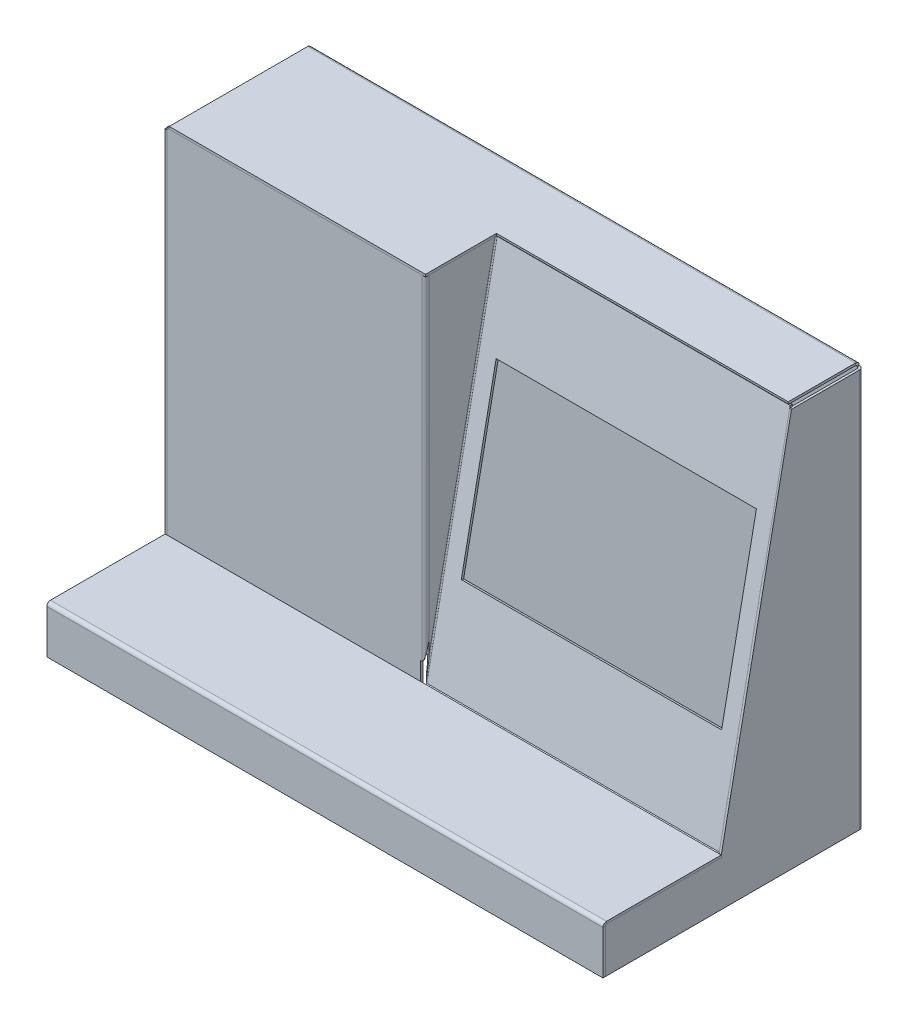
ISO-10303-21;
HEADER;
FILE_DESCRIPTION(('STEP AP214'),'2;1');
FILE_NAME('part.step','',(''),(''),'','','');
FILE_SCHEMA(('AUTOMOTIVE_DESIGN { 1 0 10303 214 1 1 1 1 }'));
ENDSEC;
DATA;
#1=APPLICATION_CONTEXT('core data for automotive mechanical design processes');
#2=APPLICATION_PROTOCOL_DEFINITION('international standard','automotive_design',2000,#1);
#3=PRODUCT_CONTEXT('',#1,'mechanical');
#4=PRODUCT('Part','Part','',(#3));
#5=PRODUCT_RELATED_PRODUCT_CATEGORY('part','',(#4));
#6=PRODUCT_DEFINITION_FORMATION('','',#4);
#7=PRODUCT_DEFINITION_CONTEXT('part definition',#1,'design');
#8=PRODUCT_DEFINITION('design','',#6,#7);
#9=PRODUCT_DEFINITION_SHAPE('','',#8);
#10=(LENGTH_UNIT() NAMED_UNIT(*) SI_UNIT(.MILLI.,.METRE.));
#11=(NAMED_UNIT(*) PLANE_ANGLE_UNIT() SI_UNIT($,.RADIAN.));
#12=(NAMED_UNIT(*) SI_UNIT($,.STERADIAN.) SOLID_ANGLE_UNIT());
#13=UNCERTAINTY_MEASURE_WITH_UNIT(LENGTH_MEASURE(1.E-05),#10,'distance_accuracy_value','');
#14=(GEOMETRIC_REPRESENTATION_CONTEXT(3) GLOBAL_UNCERTAINTY_ASSIGNED_CONTEXT((#13)) GLOBAL_UNIT_ASSIGNED_CONTEXT((#10,
#11,#12)) REPRESENTATION_CONTEXT('',''));
#15=CARTESIAN_POINT('',(0.,0.,0.));
#16=DIRECTION('',(0.,0.,1.));
#17=DIRECTION('',(1.,0.,0.));
#18=AXIS2_PLACEMENT_3D('',#15,#16,#17);
#19=CARTESIAN_POINT('',(470.,40.,0.));
#20=DIRECTION('',(-1.,0.,0.));
#21=DIRECTION('',(0.,0.,-1.));
#22=AXIS2_PLACEMENT_3D('',#19,#20,#21);
#23=PLANE('',#22);
#24=DIRECTION('',(0.,1.,0.));
#25=VECTOR('',#24,1.);
#26=CARTESIAN_POINT('',(470.,40.,-3.));
#27=LINE('',#26,#25);
#28=CARTESIAN_POINT('',(470.,38.,-3.));
#29=VERTEX_POINT('',#28);
#30=CARTESIAN_POINT('',(470.,40.,-3.));
#31=VERTEX_POINT('',#30);
#32=EDGE_CURVE('E13',#29,#31,#27,.T.);
#33=ORIENTED_EDGE('',*,*,#32,.F.);
#34=DIRECTION('',(0.,0.,-1.));
#35=VECTOR('',#34,1.);
#36=CARTESIAN_POINT('',(470.,38.,-220.));
#37=LINE('',#36,#35);
#38=CARTESIAN_POINT('',(470.,38.,-100.));
#39=VERTEX_POINT('',#38);
#40=EDGE_CURVE('E140',#29,#39,#37,.T.);
#41=ORIENTED_EDGE('',*,*,#40,.T.);
#42=DIRECTION('',(0.,1.,0.));
#43=VECTOR('',#42,1.);
#44=CARTESIAN_POINT('',(470.,40.,-100.));
#45=LINE('',#44,#43);
#46=CARTESIAN_POINT('',(470.,40.,-100.));
#47=VERTEX_POINT('',#46);
#48=EDGE_CURVE('E61',#39,#47,#45,.T.);
#49=ORIENTED_EDGE('',*,*,#48,.T.);
#50=DIRECTION('',(0.,0.,-1.));
#51=VECTOR('',#50,1.);
#52=CARTESIAN_POINT('',(470.,40.,0.));
#53=LINE('',#52,#51);
#54=EDGE_CURVE('E170',#31,#47,#53,.T.);
#55=ORIENTED_EDGE('',*,*,#54,.F.);
#56=EDGE_LOOP('',(#33,#41,#49,#55));
#57=FACE_BOUND('',#56,.T.);
#58=ADVANCED_FACE('F51',(#57),#23,.F.);
#59=CARTESIAN_POINT('',(775.941170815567,40.,-100.));
#60=DIRECTION('',(0.,0.,1.));
#61=DIRECTION('',(-1.,0.,0.));
#62=AXIS2_PLACEMENT_3D('',#59,#60,#61);
#63=PLANE('',#62);
#64=ORIENTED_EDGE('',*,*,#48,.F.);
#65=DIRECTION('',(1.,0.,0.));
#66=VECTOR('',#65,1.);
#67=CARTESIAN_POINT('',(0.,38.,-100.));
#68=LINE('',#67,#66);
#69=CARTESIAN_POINT('',(0.,38.,-100.));
#70=VERTEX_POINT('',#69);
#71=EDGE_CURVE('E145',#39,#70,#68,.F.);
#72=ORIENTED_EDGE('',*,*,#71,.T.);
#73=DIRECTION('',(0.,1.,0.));
#74=VECTOR('',#73,1.);
#75=CARTESIAN_POINT('',(0.,40.,-100.));
#76=LINE('',#75,#74);
#77=CARTESIAN_POINT('',(0.,40.,-100.));
#78=VERTEX_POINT('',#77);
#79=EDGE_CURVE('E160',#70,#78,#76,.T.);
#80=ORIENTED_EDGE('',*,*,#79,.T.);
#81=DIRECTION('',(-1.,0.,0.));
#82=VECTOR('',#81,1.);
#83=CARTESIAN_POINT('',(775.941170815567,40.,-100.));
#84=LINE('',#83,#82);
#85=EDGE_CURVE('E181',#47,#78,#84,.T.);
#86=ORIENTED_EDGE('',*,*,#85,.F.);
#87=EDGE_LOOP('',(#64,#72,#80,#86));
#88=FACE_BOUND('',#87,.T.);
#89=ADVANCED_FACE('F188',(#88),#63,.F.);
#90=CARTESIAN_POINT('',(0.,40.,0.));
#91=DIRECTION('',(1.,0.,0.));
#92=DIRECTION('',(0.,0.,1.));
#93=AXIS2_PLACEMENT_3D('',#90,#91,#92);
#94=PLANE('',#93);
#95=ORIENTED_EDGE('',*,*,#79,.F.);
#96=DIRECTION('',(0.,0.,-1.));
#97=VECTOR('',#96,1.);
#98=CARTESIAN_POINT('',(0.,38.,-220.));
#99=LINE('',#98,#97);
#100=CARTESIAN_POINT('',(0.,38.,-3.));
#101=VERTEX_POINT('',#100);
#102=EDGE_CURVE('E146',#70,#101,#99,.F.);
#103=ORIENTED_EDGE('',*,*,#102,.T.);
#104=DIRECTION('',(0.,1.,0.));
#105=VECTOR('',#104,1.);
#106=CARTESIAN_POINT('',(0.,40.,-3.));
#107=LINE('',#106,#105);
#108=CARTESIAN_POINT('',(0.,40.,-3.));
#109=VERTEX_POINT('',#108);
#110=EDGE_CURVE('E157',#101,#109,#107,.T.);
#111=ORIENTED_EDGE('',*,*,#110,.T.);
#112=DIRECTION('',(0.,0.,1.));
#113=VECTOR('',#112,1.);
#114=CARTESIAN_POINT('',(0.,40.,0.));
#115=LINE('',#114,#113);
#116=EDGE_CURVE('E186',#78,#109,#115,.T.);
#117=ORIENTED_EDGE('',*,*,#116,.F.);
#118=EDGE_LOOP('',(#95,#103,#111,#117));
#119=FACE_BOUND('',#118,.T.);
#120=ADVANCED_FACE('F234',(#119),#94,.F.);
#121=CARTESIAN_POINT('',(0.,37.,-3.));
#122=DIRECTION('',(1.,0.,0.));
#123=DIRECTION('',(0.,0.,-1.));
#124=AXIS2_PLACEMENT_3D('',#121,#122,#123);
#125=PLANE('',#124);
#126=ORIENTED_EDGE('',*,*,#110,.F.);
#127=CARTESIAN_POINT('',(0.,37.,-3.));
#128=DIRECTION('',(1.,0.,0.));
#129=DIRECTION('',(0.,0.,-1.));
#130=AXIS2_PLACEMENT_3D('',#127,#128,#129);
#131=CIRCLE('',#130,1.);
#132=CARTESIAN_POINT('',(0.,37.,-2.));
#133=VERTEX_POINT('',#132);
#134=EDGE_CURVE('E133',#101,#133,#131,.T.);
#135=ORIENTED_EDGE('',*,*,#134,.T.);
#136=DIRECTION('',(0.,0.,1.));
#137=VECTOR('',#136,1.);
#138=CARTESIAN_POINT('',(0.,37.,0.));
#139=LINE('',#138,#137);
#140=CARTESIAN_POINT('',(0.,37.,0.));
#141=VERTEX_POINT('',#140);
#142=EDGE_CURVE('E69',#133,#141,#139,.T.);
#143=ORIENTED_EDGE('',*,*,#142,.T.);
#144=CARTESIAN_POINT('',(0.,37.,-3.));
#145=DIRECTION('',(-1.,0.,0.));
#146=DIRECTION('',(0.,0.,1.));
#147=AXIS2_PLACEMENT_3D('',#144,#145,#146);
#148=CIRCLE('',#147,3.);
#149=EDGE_CURVE('E189',#109,#141,#148,.F.);
#150=ORIENTED_EDGE('',*,*,#149,.F.);
#151=EDGE_LOOP('',(#126,#135,#143,#150));
#152=FACE_BOUND('',#151,.T.);
#153=ADVANCED_FACE('F227',(#152),#125,.F.);
#154=CARTESIAN_POINT('',(0.,40.,0.));
#155=DIRECTION('',(1.,0.,0.));
#156=DIRECTION('',(0.,-1.,0.));
#157=AXIS2_PLACEMENT_3D('',#154,#155,#156);
#158=PLANE('',#157);
#159=ORIENTED_EDGE('',*,*,#142,.F.);
#160=DIRECTION('',(0.,1.,0.));
#161=VECTOR('',#160,1.);
#162=CARTESIAN_POINT('',(0.,40.,-2.));
#163=LINE('',#162,#161);
#164=CARTESIAN_POINT('',(0.,0.,-2.));
#165=VERTEX_POINT('',#164);
#166=EDGE_CURVE('E125',#133,#165,#163,.F.);
#167=ORIENTED_EDGE('',*,*,#166,.T.);
#168=DIRECTION('',(0.,0.,1.));
#169=VECTOR('',#168,1.);
#170=CARTESIAN_POINT('',(0.,0.,0.));
#171=LINE('',#170,#169);
#172=CARTESIAN_POINT('',(0.,0.,0.));
#173=VERTEX_POINT('',#172);
#174=EDGE_CURVE('E153',#165,#173,#171,.T.);
#175=ORIENTED_EDGE('',*,*,#174,.T.);
#176=DIRECTION('',(0.,-1.,0.));
#177=VECTOR('',#176,1.);
#178=CARTESIAN_POINT('',(0.,40.,0.));
#179=LINE('',#178,#177);
#180=EDGE_CURVE('E203',#141,#173,#179,.T.);
#181=ORIENTED_EDGE('',*,*,#180,.F.);
#182=EDGE_LOOP('',(#159,#167,#175,#181));
#183=FACE_BOUND('',#182,.T.);
#184=ADVANCED_FACE('F225',(#183),#158,.F.);
#185=CARTESIAN_POINT('',(0.,0.,0.));
#186=DIRECTION('',(0.,1.,0.));
#187=DIRECTION('',(1.,0.,0.));
#188=AXIS2_PLACEMENT_3D('',#185,#186,#187);
#189=PLANE('',#188);
#190=ORIENTED_EDGE('',*,*,#174,.F.);
#191=DIRECTION('',(-1.,0.,0.));
#192=VECTOR('',#191,1.);
#193=CARTESIAN_POINT('',(0.,0.,-2.));
#194=LINE('',#193,#192);
#195=CARTESIAN_POINT('',(470.,0.,-2.));
#196=VERTEX_POINT('',#195);
#197=EDGE_CURVE('E137',#165,#196,#194,.F.);
#198=ORIENTED_EDGE('',*,*,#197,.T.);
#199=DIRECTION('',(0.,0.,1.));
#200=VECTOR('',#199,1.);
#201=CARTESIAN_POINT('',(470.,0.,0.));
#202=LINE('',#201,#200);
#203=CARTESIAN_POINT('',(470.,0.,0.));
#204=VERTEX_POINT('',#203);
#205=EDGE_CURVE('E113',#196,#204,#202,.T.);
#206=ORIENTED_EDGE('',*,*,#205,.T.);
#207=DIRECTION('',(1.,0.,0.));
#208=VECTOR('',#207,1.);
#209=CARTESIAN_POINT('',(0.,0.,0.));
#210=LINE('',#209,#208);
#211=EDGE_CURVE('E185',#173,#204,#210,.T.);
#212=ORIENTED_EDGE('',*,*,#211,.F.);
#213=EDGE_LOOP('',(#190,#198,#206,#212));
#214=FACE_BOUND('',#213,.T.);
#215=ADVANCED_FACE('F218',(#214),#189,.F.);
#216=CARTESIAN_POINT('',(470.,40.,0.));
#217=DIRECTION('',(1.,0.,0.));
#218=DIRECTION('',(0.,-1.,0.));
#219=AXIS2_PLACEMENT_3D('',#216,#217,#218);
#220=PLANE('',#219);
#221=ORIENTED_EDGE('',*,*,#205,.F.);
#222=DIRECTION('',(0.,1.,0.));
#223=VECTOR('',#222,1.);
#224=CARTESIAN_POINT('',(470.,40.,-2.));
#225=LINE('',#224,#223);
#226=CARTESIAN_POINT('',(470.,37.,-2.));
#227=VERTEX_POINT('',#226);
#228=EDGE_CURVE('E122',#227,#196,#225,.F.);
#229=ORIENTED_EDGE('',*,*,#228,.F.);
#230=DIRECTION('',(0.,0.,1.));
#231=VECTOR('',#230,1.);
#232=CARTESIAN_POINT('',(470.,37.,0.));
#233=LINE('',#232,#231);
#234=CARTESIAN_POINT('',(470.,37.,0.));
#235=VERTEX_POINT('',#234);
#236=EDGE_CURVE('E55',#227,#235,#233,.T.);
#237=ORIENTED_EDGE('',*,*,#236,.T.);
#238=DIRECTION('',(0.,-1.,0.));
#239=VECTOR('',#238,1.);
#240=CARTESIAN_POINT('',(470.,40.,0.));
#241=LINE('',#240,#239);
#242=EDGE_CURVE('E222',#235,#204,#241,.T.);
#243=ORIENTED_EDGE('',*,*,#242,.T.);
#244=EDGE_LOOP('',(#221,#229,#237,#243));
#245=FACE_BOUND('',#244,.T.);
#246=ADVANCED_FACE('F135',(#245),#220,.T.);
#247=CARTESIAN_POINT('',(470.,37.,-3.));
#248=DIRECTION('',(1.,0.,0.));
#249=DIRECTION('',(0.,0.,-1.));
#250=AXIS2_PLACEMENT_3D('',#247,#248,#249);
#251=PLANE('',#250);
#252=CARTESIAN_POINT('',(470.,37.,-3.));
#253=DIRECTION('',(1.,0.,0.));
#254=DIRECTION('',(0.,0.,-1.));
#255=AXIS2_PLACEMENT_3D('',#252,#253,#254);
#256=CIRCLE('',#255,1.);
#257=EDGE_CURVE('E105',#227,#29,#256,.F.);
#258=ORIENTED_EDGE('',*,*,#257,.T.);
#259=ORIENTED_EDGE('',*,*,#32,.T.);
#260=CARTESIAN_POINT('',(470.,37.,-3.));
#261=DIRECTION('',(-1.,0.,0.));
#262=DIRECTION('',(0.,0.,1.));
#263=AXIS2_PLACEMENT_3D('',#260,#261,#262);
#264=CIRCLE('',#263,3.);
#265=EDGE_CURVE('E107',#235,#31,#264,.T.);
#266=ORIENTED_EDGE('',*,*,#265,.F.);
#267=ORIENTED_EDGE('',*,*,#236,.F.);
#268=EDGE_LOOP('',(#258,#259,#266,#267));
#269=FACE_BOUND('',#268,.T.);
#270=ADVANCED_FACE('F53',(#269),#251,.T.);
#271=CARTESIAN_POINT('',(0.,40.,0.));
#272=DIRECTION('',(0.,0.,-1.));
#273=DIRECTION('',(-1.,0.,0.));
#274=AXIS2_PLACEMENT_3D('',#271,#272,#273);
#275=PLANE('',#274);
#276=ORIENTED_EDGE('',*,*,#242,.F.);
#277=DIRECTION('',(1.,0.,0.));
#278=VECTOR('',#277,1.);
#279=CARTESIAN_POINT('',(0.,37.,0.));
#280=LINE('',#279,#278);
#281=EDGE_CURVE('E114',#235,#141,#280,.F.);
#282=ORIENTED_EDGE('',*,*,#281,.T.);
#283=ORIENTED_EDGE('',*,*,#180,.T.);
#284=ORIENTED_EDGE('',*,*,#211,.T.);
#285=EDGE_LOOP('',(#276,#282,#283,#284));
#286=FACE_BOUND('',#285,.T.);
#287=ADVANCED_FACE('F221',(#286),#275,.F.);
#288=CARTESIAN_POINT('',(0.,40.,-220.));
#289=DIRECTION('',(0.,-1.,0.));
#290=DIRECTION('',(0.,0.,-1.));
#291=AXIS2_PLACEMENT_3D('',#288,#289,#290);
#292=PLANE('',#291);
#293=ORIENTED_EDGE('',*,*,#116,.T.);
#294=DIRECTION('',(1.,0.,0.));
#295=VECTOR('',#294,1.);
#296=CARTESIAN_POINT('',(0.,40.,-3.));
#297=LINE('',#296,#295);
#298=EDGE_CURVE('E184',#109,#31,#297,.T.);
#299=ORIENTED_EDGE('',*,*,#298,.T.);
#300=ORIENTED_EDGE('',*,*,#54,.T.);
#301=ORIENTED_EDGE('',*,*,#85,.T.);
#302=EDGE_LOOP('',(#293,#299,#300,#301));
#303=FACE_BOUND('',#302,.T.);
#304=ADVANCED_FACE('F180',(#303),#292,.F.);
#305=CARTESIAN_POINT('',(0.,37.,-3.));
#306=DIRECTION('',(1.,0.,0.));
#307=DIRECTION('',(0.,0.,-1.));
#308=AXIS2_PLACEMENT_3D('',#305,#306,#307);
#309=CYLINDRICAL_SURFACE('',#308,3.);
#310=ORIENTED_EDGE('',*,*,#149,.T.);
#311=ORIENTED_EDGE('',*,*,#281,.F.);
#312=ORIENTED_EDGE('',*,*,#265,.T.);
#313=ORIENTED_EDGE('',*,*,#298,.F.);
#314=EDGE_LOOP('',(#310,#311,#312,#313));
#315=FACE_BOUND('',#314,.T.);
#316=ADVANCED_FACE('F208',(#315),#309,.T.);
#317=CARTESIAN_POINT('',(0.,40.,-2.));
#318=DIRECTION('',(0.,0.,-1.));
#319=DIRECTION('',(-1.,0.,0.));
#320=AXIS2_PLACEMENT_3D('',#317,#318,#319);
#321=PLANE('',#320);
#322=ORIENTED_EDGE('',*,*,#228,.T.);
#323=ORIENTED_EDGE('',*,*,#197,.F.);
#324=ORIENTED_EDGE('',*,*,#166,.F.);
#325=DIRECTION('',(-1.,0.,0.));
#326=VECTOR('',#325,1.);
#327=CARTESIAN_POINT('',(0.,37.,-2.));
#328=LINE('',#327,#326);
#329=EDGE_CURVE('E119',#227,#133,#328,.T.);
#330=ORIENTED_EDGE('',*,*,#329,.F.);
#331=EDGE_LOOP('',(#322,#323,#324,#330));
#332=FACE_BOUND('',#331,.T.);
#333=ADVANCED_FACE('F120',(#332),#321,.T.);
#334=CARTESIAN_POINT('',(0.,38.,-220.));
#335=DIRECTION('',(0.,-1.,0.));
#336=DIRECTION('',(0.,0.,-1.));
#337=AXIS2_PLACEMENT_3D('',#334,#335,#336);
#338=PLANE('',#337);
#339=ORIENTED_EDGE('',*,*,#102,.F.);
#340=ORIENTED_EDGE('',*,*,#71,.F.);
#341=ORIENTED_EDGE('',*,*,#40,.F.);
#342=DIRECTION('',(1.,0.,0.));
#343=VECTOR('',#342,1.);
#344=CARTESIAN_POINT('',(0.,38.,-3.));
#345=LINE('',#344,#343);
#346=EDGE_CURVE('E128',#101,#29,#345,.T.);
#347=ORIENTED_EDGE('',*,*,#346,.F.);
#348=EDGE_LOOP('',(#339,#340,#341,#347));
#349=FACE_BOUND('',#348,.T.);
#350=ADVANCED_FACE('F248',(#349),#338,.T.);
#351=CARTESIAN_POINT('',(0.,37.,-3.));
#352=DIRECTION('',(1.,0.,0.));
#353=DIRECTION('',(0.,0.,-1.));
#354=AXIS2_PLACEMENT_3D('',#351,#352,#353);
#355=CYLINDRICAL_SURFACE('',#354,1.);
#356=ORIENTED_EDGE('',*,*,#134,.F.);
#357=ORIENTED_EDGE('',*,*,#346,.T.);
#358=ORIENTED_EDGE('',*,*,#257,.F.);
#359=ORIENTED_EDGE('',*,*,#329,.T.);
#360=EDGE_LOOP('',(#356,#357,#358,#359));
#361=FACE_BOUND('',#360,.T.);
#362=ADVANCED_FACE('F130',(#361),#355,.F.);
#363=CLOSED_SHELL('',(#58,#89,#120,#153,#184,#215,#246,#270,#287,#304,#316,#333,#350,#362));
#364=MANIFOLD_SOLID_BREP('B2',#363);
#365=CARTESIAN_POINT('',(235.,263.543550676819,-144.708710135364));
#366=DIRECTION('',(0.,0.98058067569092,-0.196116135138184));
#367=DIRECTION('',(-1.,0.,0.));
#368=AXIS2_PLACEMENT_3D('',#365,#366,#367);
#369=PLANE('',#368);
#370=DIRECTION('',(0.,0.196116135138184,0.98058067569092));
#371=VECTOR('',#370,1.);
#372=CARTESIAN_POINT('',(235.,263.543550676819,-144.708710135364));
#373=LINE('',#372,#371);
#374=CARTESIAN_POINT('',(235.,263.151318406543,-146.669871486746));
#375=VERTEX_POINT('',#374);
#376=CARTESIAN_POINT('',(235.,263.543550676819,-144.708710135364));
#377=VERTEX_POINT('',#376);
#378=EDGE_CURVE('E49',#375,#377,#373,.T.);
#379=ORIENTED_EDGE('',*,*,#378,.F.);
#380=DIRECTION('',(1.,0.,0.));
#381=VECTOR('',#380,1.);
#382=CARTESIAN_POINT('',(775.941170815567,263.151318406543,-146.669871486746));
#383=LINE('',#382,#381);
#384=CARTESIAN_POINT('',(455.,263.151318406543,-146.669871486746));
#385=VERTEX_POINT('',#384);
#386=EDGE_CURVE('E483',#385,#375,#383,.F.);
#387=ORIENTED_EDGE('',*,*,#386,.F.);
#388=DIRECTION('',(0.,0.196116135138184,0.98058067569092));
#389=VECTOR('',#388,1.);
#390=CARTESIAN_POINT('',(455.,263.543550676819,-144.708710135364));
#391=LINE('',#390,#389);
#392=CARTESIAN_POINT('',(455.,263.543550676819,-144.708710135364));
#393=VERTEX_POINT('',#392);
#394=EDGE_CURVE('E392',#385,#393,#391,.T.);
#395=ORIENTED_EDGE('',*,*,#394,.T.);
#396=DIRECTION('',(-1.,0.,0.));
#397=VECTOR('',#396,1.);
#398=CARTESIAN_POINT('',(235.,263.543550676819,-144.708710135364));
#399=LINE('',#398,#397);
#400=EDGE_CURVE('E737',#393,#377,#399,.T.);
#401=ORIENTED_EDGE('',*,*,#400,.T.);
#402=EDGE_LOOP('',(#379,#387,#395,#401));
#403=FACE_BOUND('',#402,.T.);
#404=ADVANCED_FACE('F382',(#403),#369,.F.);
#405=CARTESIAN_POINT('',(455.,263.543550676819,-144.708710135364));
#406=DIRECTION('',(1.,0.,0.));
#407=DIRECTION('',(0.,0.98058067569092,-0.196116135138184));
#408=AXIS2_PLACEMENT_3D('',#405,#406,#407);
#409=PLANE('',#408);
#410=ORIENTED_EDGE('',*,*,#394,.F.);
#411=DIRECTION('',(0.,-0.98058067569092,0.196116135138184));
#412=VECTOR('',#411,1.);
#413=CARTESIAN_POINT('',(455.,39.6077677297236,-101.961161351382));
#414=LINE('',#413,#412);
#415=CARTESIAN_POINT('',(455.,116.064217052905,-117.252451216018));
#416=VERTEX_POINT('',#415);
#417=EDGE_CURVE('E494',#416,#385,#414,.F.);
#418=ORIENTED_EDGE('',*,*,#417,.F.);
#419=DIRECTION('',(0.,0.196116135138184,0.98058067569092));
#420=VECTOR('',#419,1.);
#421=CARTESIAN_POINT('',(455.,116.456449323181,-115.291289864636));
#422=LINE('',#421,#420);
#423=CARTESIAN_POINT('',(455.,116.456449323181,-115.291289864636));
#424=VERTEX_POINT('',#423);
#425=EDGE_CURVE('E474',#416,#424,#422,.T.);
#426=ORIENTED_EDGE('',*,*,#425,.T.);
#427=DIRECTION('',(0.,0.98058067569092,-0.196116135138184));
#428=VECTOR('',#427,1.);
#429=CARTESIAN_POINT('',(455.,263.543550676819,-144.708710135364));
#430=LINE('',#429,#428);
#431=EDGE_CURVE('E717',#424,#393,#430,.T.);
#432=ORIENTED_EDGE('',*,*,#431,.T.);
#433=EDGE_LOOP('',(#410,#418,#426,#432));
#434=FACE_BOUND('',#433,.T.);
#435=ADVANCED_FACE('F705',(#434),#409,.F.);
#436=CARTESIAN_POINT('',(235.,116.456449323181,-115.291289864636));
#437=DIRECTION('',(0.,-0.98058067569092,0.196116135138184));
#438=DIRECTION('',(1.,0.,0.));
#439=AXIS2_PLACEMENT_3D('',#436,#437,#438);
#440=PLANE('',#439);
#441=ORIENTED_EDGE('',*,*,#425,.F.);
#442=DIRECTION('',(1.,0.,0.));
#443=VECTOR('',#442,1.);
#444=CARTESIAN_POINT('',(775.941170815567,116.064217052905,-117.252451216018));
#445=LINE('',#444,#443);
#446=CARTESIAN_POINT('',(235.,116.064217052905,-117.252451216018));
#447=VERTEX_POINT('',#446);
#448=EDGE_CURVE('E481',#447,#416,#445,.T.);
#449=ORIENTED_EDGE('',*,*,#448,.F.);
#450=DIRECTION('',(0.,0.196116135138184,0.98058067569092));
#451=VECTOR('',#450,1.);
#452=CARTESIAN_POINT('',(235.,116.456449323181,-115.291289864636));
#453=LINE('',#452,#451);
#454=CARTESIAN_POINT('',(235.,116.456449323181,-115.291289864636));
#455=VERTEX_POINT('',#454);
#456=EDGE_CURVE('E386',#447,#455,#453,.T.);
#457=ORIENTED_EDGE('',*,*,#456,.T.);
#458=DIRECTION('',(1.,0.,0.));
#459=VECTOR('',#458,1.);
#460=CARTESIAN_POINT('',(235.,116.456449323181,-115.291289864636));
#461=LINE('',#460,#459);
#462=EDGE_CURVE('E731',#455,#424,#461,.T.);
#463=ORIENTED_EDGE('',*,*,#462,.T.);
#464=EDGE_LOOP('',(#441,#449,#457,#463));
#465=FACE_BOUND('',#464,.T.);
#466=ADVANCED_FACE('F485',(#465),#440,.F.);
#467=CARTESIAN_POINT('',(775.941170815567,41.0148904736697,-100.202978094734));
#468=DIRECTION('',(0.,0.98058067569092,-0.196116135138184));
#469=DIRECTION('',(-1.,0.,0.));
#470=AXIS2_PLACEMENT_3D('',#467,#468,#469);
#471=PLANE('',#470);
#472=CARTESIAN_POINT('',(221.,40.6226582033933,-102.164139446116));
#473=CARTESIAN_POINT('',(221.,41.0148904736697,-100.202978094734));
#474=B_SPLINE_CURVE_WITH_KNOTS('',1,(#472,#473),.UNSPECIFIED.,.F.,.F.,(2,2),(0.,1.),.UNSPECIFIED.);
#475=CARTESIAN_POINT('',(221.000000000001,40.6226582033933,-102.164139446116));
#476=VERTEX_POINT('',#475);
#477=CARTESIAN_POINT('',(221.,41.0148904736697,-100.202978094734));
#478=VERTEX_POINT('',#477);
#479=EDGE_CURVE('E475',#476,#478,#474,.T.);
#480=ORIENTED_EDGE('',*,*,#479,.F.);
#481=DIRECTION('',(1.,0.,0.));
#482=VECTOR('',#481,1.);
#483=CARTESIAN_POINT('',(775.941170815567,40.6226582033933,-102.164139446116));
#484=LINE('',#483,#482);
#485=CARTESIAN_POINT('',(468.5,40.6226582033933,-102.164139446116));
#486=VERTEX_POINT('',#485);
#487=EDGE_CURVE('E496',#486,#476,#484,.F.);
#488=ORIENTED_EDGE('',*,*,#487,.F.);
#489=DIRECTION('',(0.,0.196116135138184,0.98058067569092));
#490=VECTOR('',#489,1.);
#491=CARTESIAN_POINT('',(468.5,41.0148904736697,-100.202978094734));
#492=LINE('',#491,#490);
#493=CARTESIAN_POINT('',(468.5,41.0148904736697,-100.202978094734));
#494=VERTEX_POINT('',#493);
#495=EDGE_CURVE('E844',#486,#494,#492,.T.);
#496=ORIENTED_EDGE('',*,*,#495,.T.);
#497=DIRECTION('',(-1.,0.,0.));
#498=VECTOR('',#497,1.);
#499=CARTESIAN_POINT('',(775.941170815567,41.0148904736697,-100.202978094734));
#500=LINE('',#499,#498);
#501=EDGE_CURVE('E514',#494,#478,#500,.T.);
#502=ORIENTED_EDGE('',*,*,#501,.T.);
#503=EDGE_LOOP('',(#480,#488,#496,#502));
#504=FACE_BOUND('',#503,.T.);
#505=ADVANCED_FACE('F585',(#504),#471,.F.);
#506=CARTESIAN_POINT('',(468.5,40.,-100.));
#507=DIRECTION('',(-1.,0.,0.));
#508=DIRECTION('',(0.,-0.98058067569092,0.196116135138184));
#509=AXIS2_PLACEMENT_3D('',#506,#507,#508);
#510=PLANE('',#509);
#511=ORIENTED_EDGE('',*,*,#495,.F.);
#512=DIRECTION('',(0.,-0.98058067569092,0.196116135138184));
#513=VECTOR('',#512,1.);
#514=CARTESIAN_POINT('',(468.5,39.6077677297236,-101.961161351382));
#515=LINE('',#514,#513);
#516=CARTESIAN_POINT('',(468.5,338.107767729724,-161.661161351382));
#517=VERTEX_POINT('',#516);
#518=EDGE_CURVE('E490',#517,#486,#515,.T.);
#519=ORIENTED_EDGE('',*,*,#518,.F.);
#520=DIRECTION('',(0.,0.196116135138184,0.98058067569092));
#521=VECTOR('',#520,1.);
#522=CARTESIAN_POINT('',(468.5,338.5,-159.7));
#523=LINE('',#522,#521);
#524=CARTESIAN_POINT('',(468.5,338.5,-159.7));
#525=VERTEX_POINT('',#524);
#526=EDGE_CURVE('E838',#517,#525,#523,.T.);
#527=ORIENTED_EDGE('',*,*,#526,.T.);
#528=DIRECTION('',(0.,-0.98058067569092,0.196116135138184));
#529=VECTOR('',#528,1.);
#530=CARTESIAN_POINT('',(468.5,40.,-100.));
#531=LINE('',#530,#529);
#532=EDGE_CURVE('E854',#525,#494,#531,.T.);
#533=ORIENTED_EDGE('',*,*,#532,.T.);
#534=EDGE_LOOP('',(#511,#519,#527,#533));
#535=FACE_BOUND('',#534,.T.);
#536=ADVANCED_FACE('F698',(#535),#510,.F.);
#537=CARTESIAN_POINT('',(775.941170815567,338.5,-159.7));
#538=DIRECTION('',(0.,-0.98058067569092,0.196116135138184));
#539=DIRECTION('',(1.,0.,0.));
#540=AXIS2_PLACEMENT_3D('',#537,#538,#539);
#541=PLANE('',#540);
#542=ORIENTED_EDGE('',*,*,#526,.F.);
#543=DIRECTION('',(1.,0.,0.));
#544=VECTOR('',#543,1.);
#545=CARTESIAN_POINT('',(775.941170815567,338.107767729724,-161.661161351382));
#546=LINE('',#545,#544);
#547=CARTESIAN_POINT('',(221.,338.107767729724,-161.661161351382));
#548=VERTEX_POINT('',#547);
#549=EDGE_CURVE('E487',#548,#517,#546,.T.);
#550=ORIENTED_EDGE('',*,*,#549,.F.);
#551=DIRECTION('',(-2.22044604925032E-13,0.196116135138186,0.98058067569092));
#552=VECTOR('',#551,1.);
#553=CARTESIAN_POINT('',(221.,338.5,-159.7));
#554=LINE('',#553,#552);
#555=CARTESIAN_POINT('',(221.,338.5,-159.7));
#556=VERTEX_POINT('',#555);
#557=EDGE_CURVE('E400',#548,#556,#554,.T.);
#558=ORIENTED_EDGE('',*,*,#557,.T.);
#559=DIRECTION('',(1.,0.,0.));
#560=VECTOR('',#559,1.);
#561=CARTESIAN_POINT('',(775.941170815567,338.5,-159.7));
#562=LINE('',#561,#560);
#563=EDGE_CURVE('E733',#556,#525,#562,.T.);
#564=ORIENTED_EDGE('',*,*,#563,.T.);
#565=EDGE_LOOP('',(#542,#550,#558,#564));
#566=FACE_BOUND('',#565,.T.);
#567=ADVANCED_FACE('F690',(#566),#541,.F.);
#568=CARTESIAN_POINT('',(221.,338.5,-159.7));
#569=CARTESIAN_POINT('',(221.,338.369255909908,-160.353720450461));
#570=CARTESIAN_POINT('',(221.,338.238511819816,-161.007440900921));
#571=CARTESIAN_POINT('',(221.,338.107767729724,-161.661161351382));
#572=CARTESIAN_POINT('',(219.,338.5,-159.7));
#573=CARTESIAN_POINT('',(217.666666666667,338.369255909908,-160.353720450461));
#574=CARTESIAN_POINT('',(216.333333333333,338.238511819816,-161.007440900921));
#575=CARTESIAN_POINT('',(215.,338.107767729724,-161.661161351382));
#576=CARTESIAN_POINT('',(219.,338.5,-157.660392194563));
#577=CARTESIAN_POINT('',(217.666666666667,338.630744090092,-157.006671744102));
#578=CARTESIAN_POINT('',(216.333333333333,338.761488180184,-156.352951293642));
#579=CARTESIAN_POINT('',(215.,338.892232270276,-155.699230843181));
#580=CARTESIAN_POINT('',(221.,338.5,-157.660392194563));
#581=CARTESIAN_POINT('',(221.,338.630744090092,-157.006671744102));
#582=CARTESIAN_POINT('',(221.,338.761488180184,-156.352951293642));
#583=CARTESIAN_POINT('',(221.,338.892232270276,-155.699230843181));
#584=CARTESIAN_POINT('',(223.,338.5,-157.660392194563));
#585=CARTESIAN_POINT('',(224.333333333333,338.630744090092,-157.006671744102));
#586=CARTESIAN_POINT('',(225.666666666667,338.761488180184,-156.352951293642));
#587=CARTESIAN_POINT('',(227.,338.892232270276,-155.699230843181));
#588=CARTESIAN_POINT('',(223.,338.5,-159.7));
#589=CARTESIAN_POINT('',(224.333333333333,338.369255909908,-160.353720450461));
#590=CARTESIAN_POINT('',(225.666666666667,338.238511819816,-161.007440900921));
#591=CARTESIAN_POINT('',(227.,338.107767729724,-161.661161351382));
#592=CARTESIAN_POINT('',(221.,338.5,-159.7));
#593=CARTESIAN_POINT('',(221.,338.369255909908,-160.353720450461));
#594=CARTESIAN_POINT('',(221.,338.238511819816,-161.007440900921));
#595=CARTESIAN_POINT('',(221.,338.107767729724,-161.661161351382));
#596=(BOUNDED_SURFACE() B_SPLINE_SURFACE(3,3,((#568,#569,#570,#571),(#572,#573,#574,#575),(#576,
#577,#578,#579),(#580,#581,#582,#583),(#584,#585,#586,#587),(#588,#589,#590,#591),(#592,#593,
#594,#595)),.UNSPECIFIED.,.T.,.F.,.F.) B_SPLINE_SURFACE_WITH_KNOTS((4,3,4),(4,4),(0.,0.5,1.),
(0.,1.),.UNSPECIFIED.) GEOMETRIC_REPRESENTATION_ITEM() RATIONAL_B_SPLINE_SURFACE(((1.,1.,1.,1.),
(0.333333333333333,0.333333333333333,0.333333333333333,0.333333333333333),(0.333333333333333,
0.333333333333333,0.333333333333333,0.333333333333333),(1.,1.,1.,1.),(0.333333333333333,
0.333333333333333,0.333333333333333,0.333333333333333),(0.333333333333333,0.333333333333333,
0.333333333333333,0.333333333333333),(1.,1.,1.,1.))) REPRESENTATION_ITEM('') SURFACE());
#597=CARTESIAN_POINT('',(221.,338.5,-158.680196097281));
#598=DIRECTION('',(0.,0.991454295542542,-0.1304545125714));
#599=DIRECTION('',(0.,-0.1304545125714,-0.991454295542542));
#600=AXIS2_PLACEMENT_3D('',#597,#598,#599);
#601=ELLIPSE('',#600,3.00665927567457,3.);
#602=CARTESIAN_POINT('',(218.,338.5,-158.680196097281));
#603=VERTEX_POINT('',#602);
#604=EDGE_CURVE('E794',#548,#603,#601,.T.);
#605=DIRECTION('',(1.,0.,0.));
#606=VECTOR('',#605,1.);
#607=CARTESIAN_POINT('',(220.,338.5,-158.680196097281));
#608=LINE('',#607,#606);
#609=CARTESIAN_POINT('',(220.,338.5,-158.680196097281));
#610=VERTEX_POINT('',#609);
#611=EDGE_CURVE('E833',#603,#610,#608,.T.);
#612=CARTESIAN_POINT('',(221.,338.5,-158.680196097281));
#613=DIRECTION('',(0.,1.,0.));
#614=DIRECTION('',(0.,0.,-1.));
#615=AXIS2_PLACEMENT_3D('',#612,#613,#614);
#616=ELLIPSE('',#615,1.01980390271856,1.);
#617=EDGE_CURVE('E501',#556,#610,#616,.T.);
#618=ORIENTED_EDGE('',*,*,#557,.F.);
#619=ORIENTED_EDGE('',*,*,#604,.T.);
#620=ORIENTED_EDGE('',*,*,#611,.T.);
#621=ORIENTED_EDGE('',*,*,#617,.F.);
#622=EDGE_LOOP('',(#618,#619,#620,#621));
#623=FACE_BOUND('',#622,.T.);
#624=ADVANCED_FACE('F684',(#623),#596,.F.);
#625=CARTESIAN_POINT('',(220.,338.5,-100.));
#626=DIRECTION('',(0.,-1.,0.));
#627=DIRECTION('',(0.,0.,1.));
#628=AXIS2_PLACEMENT_3D('',#625,#626,#627);
#629=PLANE('',#628);
#630=ORIENTED_EDGE('',*,*,#611,.F.);
#631=DIRECTION('',(0.,0.,1.));
#632=VECTOR('',#631,1.);
#633=CARTESIAN_POINT('',(218.,338.5,-100.));
#634=LINE('',#633,#632);
#635=CARTESIAN_POINT('',(218.,338.5,-103.));
#636=VERTEX_POINT('',#635);
#637=EDGE_CURVE('E784',#603,#636,#634,.T.);
#638=ORIENTED_EDGE('',*,*,#637,.T.);
#639=DIRECTION('',(1.,0.,0.));
#640=VECTOR('',#639,1.);
#641=CARTESIAN_POINT('',(220.,338.5,-103.));
#642=LINE('',#641,#640);
#643=CARTESIAN_POINT('',(220.,338.5,-103.));
#644=VERTEX_POINT('',#643);
#645=EDGE_CURVE('E829',#636,#644,#642,.T.);
#646=ORIENTED_EDGE('',*,*,#645,.T.);
#647=DIRECTION('',(0.,0.,1.));
#648=VECTOR('',#647,1.);
#649=CARTESIAN_POINT('',(220.,338.5,-100.));
#650=LINE('',#649,#648);
#651=EDGE_CURVE('E762',#610,#644,#650,.T.);
#652=ORIENTED_EDGE('',*,*,#651,.F.);
#653=EDGE_LOOP('',(#630,#638,#646,#652));
#654=FACE_BOUND('',#653,.T.);
#655=ADVANCED_FACE('F680',(#654),#629,.F.);
#656=CARTESIAN_POINT('',(217.,338.5,-103.));
#657=DIRECTION('',(0.,-1.,0.));
#658=DIRECTION('',(0.,0.,-1.));
#659=AXIS2_PLACEMENT_3D('',#656,#657,#658);
#660=PLANE('',#659);
#661=ORIENTED_EDGE('',*,*,#645,.F.);
#662=CARTESIAN_POINT('',(217.,338.5,-103.));
#663=DIRECTION('',(0.,-1.,0.));
#664=DIRECTION('',(0.,0.,-1.));
#665=AXIS2_PLACEMENT_3D('',#662,#663,#664);
#666=CIRCLE('',#665,1.);
#667=CARTESIAN_POINT('',(217.,338.5,-102.));
#668=VERTEX_POINT('',#667);
#669=EDGE_CURVE('E774',#636,#668,#666,.T.);
#670=ORIENTED_EDGE('',*,*,#669,.T.);
#671=DIRECTION('',(0.,0.,1.));
#672=VECTOR('',#671,1.);
#673=CARTESIAN_POINT('',(217.,338.5,-100.));
#674=LINE('',#673,#672);
#675=CARTESIAN_POINT('',(217.,338.5,-100.));
#676=VERTEX_POINT('',#675);
#677=EDGE_CURVE('E827',#668,#676,#674,.T.);
#678=ORIENTED_EDGE('',*,*,#677,.T.);
#679=CARTESIAN_POINT('',(217.,338.5,-103.));
#680=DIRECTION('',(0.,1.,0.));
#681=DIRECTION('',(0.,0.,1.));
#682=AXIS2_PLACEMENT_3D('',#679,#680,#681);
#683=CIRCLE('',#682,3.);
#684=EDGE_CURVE('E759',#644,#676,#683,.F.);
#685=ORIENTED_EDGE('',*,*,#684,.F.);
#686=EDGE_LOOP('',(#661,#670,#678,#685));
#687=FACE_BOUND('',#686,.T.);
#688=ADVANCED_FACE('F676',(#687),#660,.F.);
#689=CARTESIAN_POINT('',(0.,338.5,-100.));
#690=DIRECTION('',(0.,-1.,0.));
#691=DIRECTION('',(-1.,0.,0.));
#692=AXIS2_PLACEMENT_3D('',#689,#690,#691);
#693=PLANE('',#692);
#694=ORIENTED_EDGE('',*,*,#677,.F.);
#695=DIRECTION('',(-1.,0.,0.));
#696=VECTOR('',#695,1.);
#697=CARTESIAN_POINT('',(0.,338.5,-102.));
#698=LINE('',#697,#696);
#699=CARTESIAN_POINT('',(1.5,338.5,-102.));
#700=VERTEX_POINT('',#699);
#701=EDGE_CURVE('E783',#668,#700,#698,.T.);
#702=ORIENTED_EDGE('',*,*,#701,.T.);
#703=DIRECTION('',(0.,0.,1.));
#704=VECTOR('',#703,1.);
#705=CARTESIAN_POINT('',(1.5,338.5,-100.));
#706=LINE('',#705,#704);
#707=CARTESIAN_POINT('',(1.5,338.5,-100.));
#708=VERTEX_POINT('',#707);
#709=EDGE_CURVE('E897',#700,#708,#706,.T.);
#710=ORIENTED_EDGE('',*,*,#709,.T.);
#711=DIRECTION('',(-1.,0.,0.));
#712=VECTOR('',#711,1.);
#713=CARTESIAN_POINT('',(0.,338.5,-100.));
#714=LINE('',#713,#712);
#715=EDGE_CURVE('E861',#676,#708,#714,.T.);
#716=ORIENTED_EDGE('',*,*,#715,.F.);
#717=EDGE_LOOP('',(#694,#702,#710,#716));
#718=FACE_BOUND('',#717,.T.);
#719=ADVANCED_FACE('F672',(#718),#693,.F.);
#720=CARTESIAN_POINT('',(1.5,340.,-100.));
#721=DIRECTION('',(1.,0.,0.));
#722=DIRECTION('',(0.,-1.,0.));
#723=AXIS2_PLACEMENT_3D('',#720,#721,#722);
#724=PLANE('',#723);
#725=ORIENTED_EDGE('',*,*,#709,.F.);
#726=DIRECTION('',(0.,1.,0.));
#727=VECTOR('',#726,1.);
#728=CARTESIAN_POINT('',(1.5,340.,-102.));
#729=LINE('',#728,#727);
#730=CARTESIAN_POINT('',(1.5,38.5,-102.));
#731=VERTEX_POINT('',#730);
#732=EDGE_CURVE('E785',#700,#731,#729,.F.);
#733=ORIENTED_EDGE('',*,*,#732,.T.);
#734=DIRECTION('',(0.,0.,1.));
#735=VECTOR('',#734,1.);
#736=CARTESIAN_POINT('',(1.5,38.5,-100.));
#737=LINE('',#736,#735);
#738=CARTESIAN_POINT('',(1.5,38.5,-100.));
#739=VERTEX_POINT('',#738);
#740=EDGE_CURVE('E894',#731,#739,#737,.T.);
#741=ORIENTED_EDGE('',*,*,#740,.T.);
#742=DIRECTION('',(0.,-1.,0.));
#743=VECTOR('',#742,1.);
#744=CARTESIAN_POINT('',(1.5,340.,-100.));
#745=LINE('',#744,#743);
#746=EDGE_CURVE('E857',#708,#739,#745,.T.);
#747=ORIENTED_EDGE('',*,*,#746,.F.);
#748=EDGE_LOOP('',(#725,#733,#741,#747));
#749=FACE_BOUND('',#748,.T.);
#750=ADVANCED_FACE('F668',(#749),#724,.F.);
#751=CARTESIAN_POINT('',(470.01005,38.5,-100.));
#752=DIRECTION('',(0.,-1.,0.));
#753=DIRECTION('',(-1.,0.,0.));
#754=AXIS2_PLACEMENT_3D('',#751,#752,#753);
#755=PLANE('',#754);
#756=ORIENTED_EDGE('',*,*,#740,.F.);
#757=DIRECTION('',(-1.,0.,0.));
#758=VECTOR('',#757,1.);
#759=CARTESIAN_POINT('',(0.,38.5,-102.));
#760=LINE('',#759,#758);
#761=CARTESIAN_POINT('',(216.009701,38.5,-102.));
#762=VERTEX_POINT('',#761);
#763=EDGE_CURVE('E780',#762,#731,#760,.T.);
#764=ORIENTED_EDGE('',*,*,#763,.F.);
#765=DIRECTION('',(0.,0.,1.));
#766=VECTOR('',#765,1.);
#767=CARTESIAN_POINT('',(216.009701,38.5,-100.));
#768=LINE('',#767,#766);
#769=CARTESIAN_POINT('',(216.009701,38.5,-100.));
#770=VERTEX_POINT('',#769);
#771=EDGE_CURVE('E891',#762,#770,#768,.T.);
#772=ORIENTED_EDGE('',*,*,#771,.T.);
#773=DIRECTION('',(-1.,0.,0.));
#774=VECTOR('',#773,1.);
#775=CARTESIAN_POINT('',(470.01005,38.5,-100.));
#776=LINE('',#775,#774);
#777=EDGE_CURVE('E866',#770,#739,#776,.T.);
#778=ORIENTED_EDGE('',*,*,#777,.T.);
#779=EDGE_LOOP('',(#756,#764,#772,#778));
#780=FACE_BOUND('',#779,.T.);
#781=ADVANCED_FACE('F664',(#780),#755,.T.);
#782=CARTESIAN_POINT('',(216.009701,340.,-100.));
#783=DIRECTION('',(-1.,0.,0.));
#784=DIRECTION('',(0.,1.,0.));
#785=AXIS2_PLACEMENT_3D('',#782,#783,#784);
#786=PLANE('',#785);
#787=ORIENTED_EDGE('',*,*,#771,.F.);
#788=DIRECTION('',(0.,1.,0.));
#789=VECTOR('',#788,1.);
#790=CARTESIAN_POINT('',(216.009701,340.,-102.));
#791=LINE('',#790,#789);
#792=CARTESIAN_POINT('',(216.009701,55.2970585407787,-102.));
#793=VERTEX_POINT('',#792);
#794=EDGE_CURVE('E558',#762,#793,#791,.T.);
#795=ORIENTED_EDGE('',*,*,#794,.T.);
#796=DIRECTION('',(0.,0.,1.));
#797=VECTOR('',#796,1.);
#798=CARTESIAN_POINT('',(216.009701,55.2970585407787,-100.));
#799=LINE('',#798,#797);
#800=CARTESIAN_POINT('',(216.009701,55.2970585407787,-100.));
#801=VERTEX_POINT('',#800);
#802=EDGE_CURVE('E817',#793,#801,#799,.T.);
#803=ORIENTED_EDGE('',*,*,#802,.T.);
#804=DIRECTION('',(0.,1.,0.));
#805=VECTOR('',#804,1.);
#806=CARTESIAN_POINT('',(216.009701,340.,-100.));
#807=LINE('',#806,#805);
#808=EDGE_CURVE('E743',#770,#801,#807,.T.);
#809=ORIENTED_EDGE('',*,*,#808,.F.);
#810=EDGE_LOOP('',(#787,#795,#803,#809));
#811=FACE_BOUND('',#810,.T.);
#812=ADVANCED_FACE('F660',(#811),#786,.F.);
#813=CARTESIAN_POINT('',(0.,55.2970585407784,-100.));
#814=DIRECTION('',(0.,-1.,0.));
#815=DIRECTION('',(-1.,0.,0.));
#816=AXIS2_PLACEMENT_3D('',#813,#814,#815);
#817=PLANE('',#816);
#818=ORIENTED_EDGE('',*,*,#802,.F.);
#819=DIRECTION('',(-1.,0.,0.));
#820=VECTOR('',#819,1.);
#821=CARTESIAN_POINT('',(0.,55.2970585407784,-102.));
#822=LINE('',#821,#820);
#823=CARTESIAN_POINT('',(217.,55.2970585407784,-102.));
#824=VERTEX_POINT('',#823);
#825=EDGE_CURVE('E768',#824,#793,#822,.T.);
#826=ORIENTED_EDGE('',*,*,#825,.F.);
#827=DIRECTION('',(0.,0.,1.));
#828=VECTOR('',#827,1.);
#829=CARTESIAN_POINT('',(217.,55.2970585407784,-100.));
#830=LINE('',#829,#828);
#831=CARTESIAN_POINT('',(217.,55.2970585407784,-100.));
#832=VERTEX_POINT('',#831);
#833=EDGE_CURVE('E810',#824,#832,#830,.T.);
#834=ORIENTED_EDGE('',*,*,#833,.T.);
#835=DIRECTION('',(-1.,0.,0.));
#836=VECTOR('',#835,1.);
#837=CARTESIAN_POINT('',(0.,55.2970585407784,-100.));
#838=LINE('',#837,#836);
#839=EDGE_CURVE('E746',#832,#801,#838,.T.);
#840=ORIENTED_EDGE('',*,*,#839,.T.);
#841=EDGE_LOOP('',(#818,#826,#834,#840));
#842=FACE_BOUND('',#841,.T.);
#843=ADVANCED_FACE('F651',(#842),#817,.T.);
#844=CARTESIAN_POINT('',(217.,55.2970585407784,-100.));
#845=CARTESIAN_POINT('',(217.,55.2970585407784,-100.666666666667));
#846=CARTESIAN_POINT('',(217.,55.2970585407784,-101.333333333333));
#847=CARTESIAN_POINT('',(217.,55.2970585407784,-102.));
#848=CARTESIAN_POINT('',(223.,55.2970585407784,-100.));
#849=CARTESIAN_POINT('',(221.666666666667,55.2970585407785,-100.666666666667));
#850=CARTESIAN_POINT('',(220.333333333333,55.2970585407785,-101.333333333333));
#851=CARTESIAN_POINT('',(219.,55.2970585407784,-102.));
#852=CARTESIAN_POINT('',(223.,85.2970585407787,-106.));
#853=CARTESIAN_POINT('',(221.666666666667,85.2970585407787,-105.333333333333));
#854=CARTESIAN_POINT('',(220.333333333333,85.2970585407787,-104.666666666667));
#855=CARTESIAN_POINT('',(219.,85.2970585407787,-104.));
#856=CARTESIAN_POINT('',(217.,85.2970585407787,-106.));
#857=CARTESIAN_POINT('',(217.,85.2970585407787,-105.333333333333));
#858=CARTESIAN_POINT('',(217.,85.2970585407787,-104.666666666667));
#859=CARTESIAN_POINT('',(217.,85.2970585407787,-104.));
#860=CARTESIAN_POINT('',(211.,85.2970585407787,-106.));
#861=CARTESIAN_POINT('',(212.333333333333,85.2970585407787,-105.333333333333));
#862=CARTESIAN_POINT('',(213.666666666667,85.2970585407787,-104.666666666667));
#863=CARTESIAN_POINT('',(215.,85.2970585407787,-104.));
#864=CARTESIAN_POINT('',(211.,55.2970585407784,-100.));
#865=CARTESIAN_POINT('',(212.333333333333,55.2970585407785,-100.666666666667));
#866=CARTESIAN_POINT('',(213.666666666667,55.2970585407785,-101.333333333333));
#867=CARTESIAN_POINT('',(215.,55.2970585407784,-102.));
#868=CARTESIAN_POINT('',(217.,55.2970585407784,-100.));
#869=CARTESIAN_POINT('',(217.,55.2970585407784,-100.666666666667));
#870=CARTESIAN_POINT('',(217.,55.2970585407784,-101.333333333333));
#871=CARTESIAN_POINT('',(217.,55.2970585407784,-102.));
#872=(BOUNDED_SURFACE() B_SPLINE_SURFACE(3,3,((#844,#845,#846,#847),(#848,#849,#850,#851),(#852,
#853,#854,#855),(#856,#857,#858,#859),(#860,#861,#862,#863),(#864,#865,#866,#867),(#868,#869,
#870,#871)),.UNSPECIFIED.,.T.,.F.,.F.) B_SPLINE_SURFACE_WITH_KNOTS((4,3,4),(4,4),(0.,0.5,1.),
(0.,1.),.UNSPECIFIED.) GEOMETRIC_REPRESENTATION_ITEM() RATIONAL_B_SPLINE_SURFACE(((1.,1.,1.,1.),
(0.333333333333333,0.333333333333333,0.333333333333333,0.333333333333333),(0.333333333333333,
0.333333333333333,0.333333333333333,0.333333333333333),(1.,1.,1.,1.),(0.333333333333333,
0.333333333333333,0.333333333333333,0.333333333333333),(0.333333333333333,0.333333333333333,
0.333333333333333,0.333333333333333),(1.,1.,1.,1.))) REPRESENTATION_ITEM('') SURFACE());
#873=CARTESIAN_POINT('',(217.,70.2970585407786,-103.));
#874=DIRECTION('',(0.,-0.0665190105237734,-0.997785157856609));
#875=DIRECTION('',(0.,-0.997785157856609,0.0665190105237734));
#876=AXIS2_PLACEMENT_3D('',#873,#874,#875);
#877=ELLIPSE('',#876,15.033296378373,1.);
#878=CARTESIAN_POINT('',(218.,70.2970585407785,-103.));
#879=VERTEX_POINT('',#878);
#880=EDGE_CURVE('E771',#824,#879,#877,.F.);
#881=DIRECTION('',(1.,0.,0.));
#882=VECTOR('',#881,1.);
#883=CARTESIAN_POINT('',(220.,70.2970585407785,-103.));
#884=LINE('',#883,#882);
#885=CARTESIAN_POINT('',(220.,70.2970585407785,-103.));
#886=VERTEX_POINT('',#885);
#887=EDGE_CURVE('E802',#879,#886,#884,.T.);
#888=CARTESIAN_POINT('',(217.,70.2970585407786,-103.));
#889=DIRECTION('',(0.,-0.196116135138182,-0.980580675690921));
#890=DIRECTION('',(0.,-0.980580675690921,0.196116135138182));
#891=AXIS2_PLACEMENT_3D('',#888,#889,#890);
#892=ELLIPSE('',#891,15.2970585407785,3.);
#893=EDGE_CURVE('E756',#832,#886,#892,.F.);
#894=ORIENTED_EDGE('',*,*,#833,.F.);
#895=ORIENTED_EDGE('',*,*,#880,.T.);
#896=ORIENTED_EDGE('',*,*,#887,.T.);
#897=ORIENTED_EDGE('',*,*,#893,.F.);
#898=EDGE_LOOP('',(#894,#895,#896,#897));
#899=FACE_BOUND('',#898,.T.);
#900=ADVANCED_FACE('F645',(#899),#872,.F.);
#901=CARTESIAN_POINT('',(220.,340.,-103.));
#902=DIRECTION('',(0.,0.,1.));
#903=DIRECTION('',(0.,1.,0.));
#904=AXIS2_PLACEMENT_3D('',#901,#902,#903);
#905=PLANE('',#904);
#906=ORIENTED_EDGE('',*,*,#887,.F.);
#907=DIRECTION('',(0.,1.,0.));
#908=VECTOR('',#907,1.);
#909=CARTESIAN_POINT('',(218.,340.,-103.));
#910=LINE('',#909,#908);
#911=CARTESIAN_POINT('',(218.,60.0990195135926,-103.));
#912=VERTEX_POINT('',#911);
#913=EDGE_CURVE('E507',#912,#879,#910,.T.);
#914=ORIENTED_EDGE('',*,*,#913,.F.);
#915=CARTESIAN_POINT('',(220.,60.0990195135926,-103.));
#916=CARTESIAN_POINT('',(218.,60.0990195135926,-103.));
#917=B_SPLINE_CURVE_WITH_KNOTS('',1,(#915,#916),.UNSPECIFIED.,.F.,.F.,(2,2),(0.,1.),.UNSPECIFIED.);
#918=CARTESIAN_POINT('',(220.,60.0990195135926,-103.));
#919=VERTEX_POINT('',#918);
#920=EDGE_CURVE('E629',#912,#919,#917,.F.);
#921=ORIENTED_EDGE('',*,*,#920,.T.);
#922=DIRECTION('',(0.,1.,0.));
#923=VECTOR('',#922,1.);
#924=CARTESIAN_POINT('',(220.,340.,-103.));
#925=LINE('',#924,#923);
#926=EDGE_CURVE('E739',#919,#886,#925,.T.);
#927=ORIENTED_EDGE('',*,*,#926,.T.);
#928=EDGE_LOOP('',(#906,#914,#921,#927));
#929=FACE_BOUND('',#928,.T.);
#930=ADVANCED_FACE('F635',(#929),#905,.T.);
#931=CARTESIAN_POINT('',(235.,263.543550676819,-144.708710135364));
#932=DIRECTION('',(-1.,0.,0.));
#933=DIRECTION('',(0.,-0.98058067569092,0.196116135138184));
#934=AXIS2_PLACEMENT_3D('',#931,#932,#933);
#935=PLANE('',#934);
#936=DIRECTION('',(0.,-0.98058067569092,0.196116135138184));
#937=VECTOR('',#936,1.);
#938=CARTESIAN_POINT('',(235.,39.6077677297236,-101.961161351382));
#939=LINE('',#938,#937);
#940=EDGE_CURVE('E466',#375,#447,#939,.T.);
#941=ORIENTED_EDGE('',*,*,#940,.F.);
#942=ORIENTED_EDGE('',*,*,#378,.T.);
#943=DIRECTION('',(0.,-0.98058067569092,0.196116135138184));
#944=VECTOR('',#943,1.);
#945=CARTESIAN_POINT('',(235.,263.543550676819,-144.708710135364));
#946=LINE('',#945,#944);
#947=EDGE_CURVE('E469',#377,#455,#946,.T.);
#948=ORIENTED_EDGE('',*,*,#947,.T.);
#949=ORIENTED_EDGE('',*,*,#456,.F.);
#950=EDGE_LOOP('',(#941,#942,#948,#949));
#951=FACE_BOUND('',#950,.T.);
#952=ADVANCED_FACE('F384',(#951),#935,.F.);
#953=CARTESIAN_POINT('',(221.,40.6226582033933,-102.164139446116));
#954=CARTESIAN_POINT('',(220.705103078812,40.6226582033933,-102.164139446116));
#955=CARTESIAN_POINT('',(220.445224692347,40.6806178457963,-102.132262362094));
#956=CARTESIAN_POINT('',(219.997054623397,40.893270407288,-102.051921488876));
#957=CARTESIAN_POINT('',(219.808612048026,41.0479695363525,-102.003426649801));
#958=CARTESIAN_POINT('',(219.491740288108,41.4385708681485,-101.91873870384));
#959=CARTESIAN_POINT('',(219.363051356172,41.6745054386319,-101.882383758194));
#960=CARTESIAN_POINT('',(219.150435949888,42.2150832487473,-101.835685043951));
#961=CARTESIAN_POINT('',(219.066419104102,42.5197576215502,-101.8251856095));
#962=CARTESIAN_POINT('',(218.861547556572,43.5211022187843,-101.83826782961));
#963=CARTESIAN_POINT('',(218.786564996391,44.3048412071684,-101.907693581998));
#964=CARTESIAN_POINT('',(218.688405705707,46.0325861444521,-102.138277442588));
#965=CARTESIAN_POINT('',(218.666140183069,46.9768611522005,-102.298090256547));
#966=CARTESIAN_POINT('',(218.630262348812,48.9598499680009,-102.648488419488));
#967=CARTESIAN_POINT('',(218.616863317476,49.9986063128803,-102.838861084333));
#968=CARTESIAN_POINT('',(218.562276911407,52.105587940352,-103.18512764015));
#969=CARTESIAN_POINT('',(218.520195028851,53.173718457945,-103.341495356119));
#970=CARTESIAN_POINT('',(218.387366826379,55.2764524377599,-103.544631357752));
#971=CARTESIAN_POINT('',(218.294091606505,56.3110435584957,-103.591461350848));
#972=CARTESIAN_POINT('',(218.150312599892,57.7941663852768,-103.505024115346));
#973=CARTESIAN_POINT('',(218.102498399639,58.2771357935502,-103.449819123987));
#974=CARTESIAN_POINT('',(218.027386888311,59.212869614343,-103.274837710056));
#975=CARTESIAN_POINT('',(218.,59.6655959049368,-103.154794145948));
#976=CARTESIAN_POINT('',(218.,60.0990195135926,-103.));
#977=CARTESIAN_POINT('',(221.,41.0148904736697,-100.202978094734));
#978=CARTESIAN_POINT('',(220.901701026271,41.0148904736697,-100.202978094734));
#979=CARTESIAN_POINT('',(220.815074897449,41.0672771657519,-100.198965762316));
#980=CARTESIAN_POINT('',(220.665684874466,41.2641769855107,-100.197388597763));
#981=CARTESIAN_POINT('',(220.602870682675,41.4086921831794,-100.199813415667));
#982=CARTESIAN_POINT('',(220.497246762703,41.7784206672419,-100.219489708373));
#983=CARTESIAN_POINT('',(220.454350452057,42.0036447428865,-100.236687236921));
#984=CARTESIAN_POINT('',(220.383478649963,42.5243745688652,-100.289228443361));
#985=CARTESIAN_POINT('',(220.355473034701,42.8198906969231,-100.324520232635));
#986=CARTESIAN_POINT('',(220.287182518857,43.7972369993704,-100.457593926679));
#987=CARTESIAN_POINT('',(220.26218833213,44.5697808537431,-100.582995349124));
#988=CARTESIAN_POINT('',(220.229468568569,46.2827866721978,-100.88727480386));
#989=CARTESIAN_POINT('',(220.22204672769,47.2233383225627,-101.065704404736));
#990=CARTESIAN_POINT('',(220.210087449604,49.200404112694,-101.445717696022));
#991=CARTESIAN_POINT('',(220.205621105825,50.2369324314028,-101.64723049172));
#992=CARTESIAN_POINT('',(220.187425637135,52.3342820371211,-102.041657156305));
#993=CARTESIAN_POINT('',(220.17339834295,53.3950717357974,-102.234728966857));
#994=CARTESIAN_POINT('',(220.12912227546,55.4699325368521,-102.577230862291));
#995=CARTESIAN_POINT('',(220.098030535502,56.4839995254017,-102.726681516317));
#996=CARTESIAN_POINT('',(220.050104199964,57.9180118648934,-102.885796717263));
#997=CARTESIAN_POINT('',(220.034166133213,58.3815198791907,-102.927898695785));
#998=CARTESIAN_POINT('',(220.00912896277,59.2708270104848,-102.985050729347));
#999=CARTESIAN_POINT('',(220.,59.6966329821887,-103.));
#1000=CARTESIAN_POINT('',(220.,60.0990195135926,-103.));
#1001=B_SPLINE_SURFACE_WITH_KNOTS('',1,3,((#953,#954,#955,#956,#957,#958,#959,#960,#961,#962,
#963,#964,#965,#966,#967,#968,#969,#970,#971,#972,#973,#974,#975,#976),(#977,#978,#979,#980,
#981,#982,#983,#984,#985,#986,#987,#988,#989,#990,#991,#992,#993,#994,#995,#996,#997,#998,#999,
#1000)),.UNSPECIFIED.,.F.,.F.,.F.,(2,2),(4,2,2,2,2,2,2,2,2,2,2,4),(0.,1.),(0.,0.0625,0.125,
0.1875,0.25,0.375,0.5,0.625,0.75,0.875,0.9375,1.),.UNSPECIFIED.);
#1002=CARTESIAN_POINT('',(218.,60.0990195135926,-103.));
#1003=CARTESIAN_POINT('',(218.,59.6655959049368,-103.154794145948));
#1004=CARTESIAN_POINT('',(218.027386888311,59.212869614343,-103.274837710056));
#1005=CARTESIAN_POINT('',(218.102498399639,58.2771357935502,-103.449819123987));
#1006=CARTESIAN_POINT('',(218.150312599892,57.7941663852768,-103.505024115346));
#1007=CARTESIAN_POINT('',(218.294091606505,56.3110435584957,-103.591461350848));
#1008=CARTESIAN_POINT('',(218.387366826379,55.2764524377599,-103.544631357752));
#1009=CARTESIAN_POINT('',(218.520195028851,53.173718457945,-103.341495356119));
#1010=CARTESIAN_POINT('',(218.562276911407,52.105587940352,-103.18512764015));
#1011=CARTESIAN_POINT('',(218.616863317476,49.9986063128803,-102.838861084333));
#1012=CARTESIAN_POINT('',(218.630262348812,48.9598499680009,-102.648488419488));
#1013=CARTESIAN_POINT('',(218.666140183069,46.9768611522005,-102.298090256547));
#1014=CARTESIAN_POINT('',(218.688405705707,46.0325861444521,-102.138277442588));
#1015=CARTESIAN_POINT('',(218.786564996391,44.3048412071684,-101.907693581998));
#1016=CARTESIAN_POINT('',(218.861547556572,43.5211022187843,-101.83826782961));
#1017=CARTESIAN_POINT('',(219.066419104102,42.5197576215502,-101.8251856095));
#1018=CARTESIAN_POINT('',(219.150435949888,42.2150832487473,-101.835685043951));
#1019=CARTESIAN_POINT('',(219.363051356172,41.6745054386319,-101.882383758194));
#1020=CARTESIAN_POINT('',(219.491740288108,41.4385708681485,-101.91873870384));
#1021=CARTESIAN_POINT('',(219.808612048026,41.0479695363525,-102.003426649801));
#1022=CARTESIAN_POINT('',(219.997054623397,40.893270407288,-102.051921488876));
#1023=CARTESIAN_POINT('',(220.445224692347,40.6806178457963,-102.132262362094));
#1024=CARTESIAN_POINT('',(220.705103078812,40.6226582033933,-102.164139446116));
#1025=CARTESIAN_POINT('',(221.,40.6226582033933,-102.164139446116));
#1026=B_SPLINE_CURVE_WITH_KNOTS('',3,(#1002,#1003,#1004,#1005,#1006,#1007,#1008,#1009,#1010,
#1011,#1012,#1013,#1014,#1015,#1016,#1017,#1018,#1019,#1020,#1021,#1022,#1023,#1024,#1025),
.UNSPECIFIED.,.F.,.F.,(4,2,2,2,2,2,2,2,2,2,2,4),(0.,0.0625,0.125,0.25,0.375,0.5,0.625,0.75,
0.8125,0.875,0.9375,1.),.UNSPECIFIED.);
#1027=EDGE_CURVE('E775',#912,#476,#1026,.T.);
#1028=CARTESIAN_POINT('',(221.,41.0148904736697,-100.202978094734));
#1029=CARTESIAN_POINT('',(220.901701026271,41.0148904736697,-100.202978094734));
#1030=CARTESIAN_POINT('',(220.815074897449,41.0672771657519,-100.198965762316));
#1031=CARTESIAN_POINT('',(220.665684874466,41.2641769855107,-100.197388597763));
#1032=CARTESIAN_POINT('',(220.602870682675,41.4086921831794,-100.199813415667));
#1033=CARTESIAN_POINT('',(220.497246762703,41.7784206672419,-100.219489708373));
#1034=CARTESIAN_POINT('',(220.454350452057,42.0036447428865,-100.236687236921));
#1035=CARTESIAN_POINT('',(220.383478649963,42.5243745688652,-100.289228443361));
#1036=CARTESIAN_POINT('',(220.355473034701,42.8198906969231,-100.324520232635));
#1037=CARTESIAN_POINT('',(220.287182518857,43.7972369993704,-100.457593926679));
#1038=CARTESIAN_POINT('',(220.26218833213,44.5697808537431,-100.582995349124));
#1039=CARTESIAN_POINT('',(220.229468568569,46.2827866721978,-100.88727480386));
#1040=CARTESIAN_POINT('',(220.22204672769,47.2233383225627,-101.065704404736));
#1041=CARTESIAN_POINT('',(220.210087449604,49.200404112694,-101.445717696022));
#1042=CARTESIAN_POINT('',(220.205621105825,50.2369324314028,-101.64723049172));
#1043=CARTESIAN_POINT('',(220.187425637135,52.3342820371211,-102.041657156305));
#1044=CARTESIAN_POINT('',(220.17339834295,53.3950717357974,-102.234728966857));
#1045=CARTESIAN_POINT('',(220.12912227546,55.4699325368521,-102.577230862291));
#1046=CARTESIAN_POINT('',(220.098030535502,56.4839995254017,-102.726681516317));
#1047=CARTESIAN_POINT('',(220.050104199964,57.9180118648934,-102.885796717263));
#1048=CARTESIAN_POINT('',(220.034166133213,58.3815198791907,-102.927898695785));
#1049=CARTESIAN_POINT('',(220.00912896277,59.2708270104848,-102.985050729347));
#1050=CARTESIAN_POINT('',(220.,59.6966329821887,-103.));
#1051=CARTESIAN_POINT('',(220.,60.0990195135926,-103.));
#1052=B_SPLINE_CURVE_WITH_KNOTS('',3,(#1028,#1029,#1030,#1031,#1032,#1033,#1034,#1035,#1036,
#1037,#1038,#1039,#1040,#1041,#1042,#1043,#1044,#1045,#1046,#1047,#1048,#1049,#1050,#1051),
.UNSPECIFIED.,.F.,.F.,(4,2,2,2,2,2,2,2,2,2,2,4),(0.,0.0625,0.125,0.1875,0.25,0.375,0.5,0.625,
0.75,0.875,0.9375,1.),.UNSPECIFIED.);
#1053=EDGE_CURVE('E565',#919,#478,#1052,.F.);
#1054=ORIENTED_EDGE('',*,*,#1027,.T.);
#1055=ORIENTED_EDGE('',*,*,#479,.T.);
#1056=ORIENTED_EDGE('',*,*,#1053,.F.);
#1057=ORIENTED_EDGE('',*,*,#920,.F.);
#1058=EDGE_LOOP('',(#1054,#1055,#1056,#1057));
#1059=FACE_BOUND('',#1058,.T.);
#1060=ADVANCED_FACE('F530',(#1059),#1001,.T.);
#1061=CARTESIAN_POINT('',(220.,340.,-100.));
#1062=DIRECTION('',(-1.,0.,0.));
#1063=DIRECTION('',(0.,0.,1.));
#1064=AXIS2_PLACEMENT_3D('',#1061,#1062,#1063);
#1065=PLANE('',#1064);
#1066=ORIENTED_EDGE('',*,*,#926,.F.);
#1067=DIRECTION('',(0.,0.98058067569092,-0.196116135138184));
#1068=VECTOR('',#1067,1.);
#1069=CARTESIAN_POINT('',(220.,328.657654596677,-156.711727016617));
#1070=LINE('',#1069,#1068);
#1071=EDGE_CURVE('E755',#919,#610,#1070,.T.);
#1072=ORIENTED_EDGE('',*,*,#1071,.T.);
#1073=ORIENTED_EDGE('',*,*,#651,.T.);
#1074=DIRECTION('',(0.,-1.,0.));
#1075=VECTOR('',#1074,1.);
#1076=CARTESIAN_POINT('',(220.,340.,-103.));
#1077=LINE('',#1076,#1075);
#1078=EDGE_CURVE('E749',#644,#886,#1077,.T.);
#1079=ORIENTED_EDGE('',*,*,#1078,.T.);
#1080=EDGE_LOOP('',(#1066,#1072,#1073,#1079));
#1081=FACE_BOUND('',#1080,.T.);
#1082=ADVANCED_FACE('F584',(#1081),#1065,.F.);
#1083=CARTESIAN_POINT('',(0.,340.,-100.));
#1084=DIRECTION('',(0.,0.,-1.));
#1085=DIRECTION('',(-1.,0.,0.));
#1086=AXIS2_PLACEMENT_3D('',#1083,#1084,#1085);
#1087=PLANE('',#1086);
#1088=ORIENTED_EDGE('',*,*,#839,.F.);
#1089=DIRECTION('',(0.,-1.,0.));
#1090=VECTOR('',#1089,1.);
#1091=CARTESIAN_POINT('',(217.,340.,-100.));
#1092=LINE('',#1091,#1090);
#1093=EDGE_CURVE('E752',#832,#676,#1092,.F.);
#1094=ORIENTED_EDGE('',*,*,#1093,.T.);
#1095=ORIENTED_EDGE('',*,*,#715,.T.);
#1096=ORIENTED_EDGE('',*,*,#746,.T.);
#1097=ORIENTED_EDGE('',*,*,#777,.F.);
#1098=ORIENTED_EDGE('',*,*,#808,.T.);
#1099=EDGE_LOOP('',(#1088,#1094,#1095,#1096,#1097,#1098));
#1100=FACE_BOUND('',#1099,.T.);
#1101=ADVANCED_FACE('F902',(#1100),#1087,.F.);
#1102=CARTESIAN_POINT('',(775.941170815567,40.,-100.));
#1103=DIRECTION('',(0.,0.196116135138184,0.98058067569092));
#1104=DIRECTION('',(0.,-0.98058067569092,0.196116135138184));
#1105=AXIS2_PLACEMENT_3D('',#1102,#1103,#1104);
#1106=PLANE('',#1105);
#1107=ORIENTED_EDGE('',*,*,#462,.F.);
#1108=ORIENTED_EDGE('',*,*,#947,.F.);
#1109=ORIENTED_EDGE('',*,*,#400,.F.);
#1110=ORIENTED_EDGE('',*,*,#431,.F.);
#1111=EDGE_LOOP('',(#1107,#1108,#1109,#1110));
#1112=FACE_BOUND('',#1111,.T.);
#1113=ORIENTED_EDGE('',*,*,#563,.F.);
#1114=DIRECTION('',(0.,0.98058067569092,-0.196116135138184));
#1115=VECTOR('',#1114,1.);
#1116=CARTESIAN_POINT('',(221.,40.,-100.));
#1117=LINE('',#1116,#1115);
#1118=EDGE_CURVE('E856',#556,#478,#1117,.F.);
#1119=ORIENTED_EDGE('',*,*,#1118,.T.);
#1120=ORIENTED_EDGE('',*,*,#501,.F.);
#1121=ORIENTED_EDGE('',*,*,#532,.F.);
#1122=EDGE_LOOP('',(#1113,#1119,#1120,#1121));
#1123=FACE_BOUND('',#1122,.T.);
#1124=ADVANCED_FACE('F735',(#1112,#1123),#1106,.T.);
#1125=CARTESIAN_POINT('',(217.,340.,-103.));
#1126=DIRECTION('',(0.,-1.,0.));
#1127=DIRECTION('',(0.,0.,-1.));
#1128=AXIS2_PLACEMENT_3D('',#1125,#1126,#1127);
#1129=CYLINDRICAL_SURFACE('',#1128,3.);
#1130=ORIENTED_EDGE('',*,*,#684,.T.);
#1131=ORIENTED_EDGE('',*,*,#1093,.F.);
#1132=ORIENTED_EDGE('',*,*,#893,.T.);
#1133=ORIENTED_EDGE('',*,*,#1078,.F.);
#1134=EDGE_LOOP('',(#1130,#1131,#1132,#1133));
#1135=FACE_BOUND('',#1134,.T.);
#1136=ADVANCED_FACE('F528',(#1135),#1129,.T.);
#1137=CARTESIAN_POINT('',(221.,328.657654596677,-156.711727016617));
#1138=DIRECTION('',(0.,0.98058067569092,-0.196116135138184));
#1139=DIRECTION('',(0.,0.196116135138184,0.98058067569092));
#1140=AXIS2_PLACEMENT_3D('',#1137,#1138,#1139);
#1141=CYLINDRICAL_SURFACE('',#1140,1.);
#1142=ORIENTED_EDGE('',*,*,#1053,.T.);
#1143=ORIENTED_EDGE('',*,*,#1118,.F.);
#1144=ORIENTED_EDGE('',*,*,#617,.T.);
#1145=ORIENTED_EDGE('',*,*,#1071,.F.);
#1146=EDGE_LOOP('',(#1142,#1143,#1144,#1145));
#1147=FACE_BOUND('',#1146,.T.);
#1148=ADVANCED_FACE('F517',(#1147),#1141,.F.);
#1149=CARTESIAN_POINT('',(218.,340.,-100.));
#1150=DIRECTION('',(-1.,0.,0.));
#1151=DIRECTION('',(0.,0.,1.));
#1152=AXIS2_PLACEMENT_3D('',#1149,#1150,#1151);
#1153=PLANE('',#1152);
#1154=ORIENTED_EDGE('',*,*,#913,.T.);
#1155=DIRECTION('',(0.,1.,0.));
#1156=VECTOR('',#1155,1.);
#1157=CARTESIAN_POINT('',(218.,340.,-103.));
#1158=LINE('',#1157,#1156);
#1159=EDGE_CURVE('E765',#636,#879,#1158,.F.);
#1160=ORIENTED_EDGE('',*,*,#1159,.F.);
#1161=ORIENTED_EDGE('',*,*,#637,.F.);
#1162=DIRECTION('',(0.,0.98058067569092,-0.196116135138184));
#1163=VECTOR('',#1162,1.);
#1164=CARTESIAN_POINT('',(218.,328.657654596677,-156.711727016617));
#1165=LINE('',#1164,#1163);
#1166=EDGE_CURVE('E502',#912,#603,#1165,.T.);
#1167=ORIENTED_EDGE('',*,*,#1166,.F.);
#1168=EDGE_LOOP('',(#1154,#1160,#1161,#1167));
#1169=FACE_BOUND('',#1168,.T.);
#1170=ADVANCED_FACE('F527',(#1169),#1153,.T.);
#1171=CARTESIAN_POINT('',(0.,340.,-102.));
#1172=DIRECTION('',(0.,0.,-1.));
#1173=DIRECTION('',(-1.,0.,0.));
#1174=AXIS2_PLACEMENT_3D('',#1171,#1172,#1173);
#1175=PLANE('',#1174);
#1176=ORIENTED_EDGE('',*,*,#825,.T.);
#1177=ORIENTED_EDGE('',*,*,#794,.F.);
#1178=ORIENTED_EDGE('',*,*,#763,.T.);
#1179=ORIENTED_EDGE('',*,*,#732,.F.);
#1180=ORIENTED_EDGE('',*,*,#701,.F.);
#1181=DIRECTION('',(0.,1.,0.));
#1182=VECTOR('',#1181,1.);
#1183=CARTESIAN_POINT('',(217.,340.,-102.));
#1184=LINE('',#1183,#1182);
#1185=EDGE_CURVE('E553',#824,#668,#1184,.T.);
#1186=ORIENTED_EDGE('',*,*,#1185,.F.);
#1187=EDGE_LOOP('',(#1176,#1177,#1178,#1179,#1180,#1186));
#1188=FACE_BOUND('',#1187,.T.);
#1189=ADVANCED_FACE('F820',(#1188),#1175,.T.);
#1190=CARTESIAN_POINT('',(775.941170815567,39.6077677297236,-101.961161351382));
#1191=DIRECTION('',(0.,0.196116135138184,0.98058067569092));
#1192=DIRECTION('',(0.,-0.98058067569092,0.196116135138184));
#1193=AXIS2_PLACEMENT_3D('',#1190,#1191,#1192);
#1194=PLANE('',#1193);
#1195=ORIENTED_EDGE('',*,*,#448,.T.);
#1196=ORIENTED_EDGE('',*,*,#417,.T.);
#1197=ORIENTED_EDGE('',*,*,#386,.T.);
#1198=ORIENTED_EDGE('',*,*,#940,.T.);
#1199=EDGE_LOOP('',(#1195,#1196,#1197,#1198));
#1200=FACE_BOUND('',#1199,.T.);
#1201=ORIENTED_EDGE('',*,*,#549,.T.);
#1202=ORIENTED_EDGE('',*,*,#518,.T.);
#1203=ORIENTED_EDGE('',*,*,#487,.T.);
#1204=DIRECTION('',(0.,-0.98058067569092,0.196116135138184));
#1205=VECTOR('',#1204,1.);
#1206=CARTESIAN_POINT('',(221.,39.6077677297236,-101.961161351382));
#1207=LINE('',#1206,#1205);
#1208=EDGE_CURVE('E498',#548,#476,#1207,.T.);
#1209=ORIENTED_EDGE('',*,*,#1208,.F.);
#1210=EDGE_LOOP('',(#1201,#1202,#1203,#1209));
#1211=FACE_BOUND('',#1210,.T.);
#1212=ADVANCED_FACE('F478',(#1200,#1211),#1194,.F.);
#1213=CARTESIAN_POINT('',(217.,340.,-103.));
#1214=DIRECTION('',(0.,-1.,0.));
#1215=DIRECTION('',(0.,0.,-1.));
#1216=AXIS2_PLACEMENT_3D('',#1213,#1214,#1215);
#1217=CYLINDRICAL_SURFACE('',#1216,1.);
#1218=ORIENTED_EDGE('',*,*,#669,.F.);
#1219=ORIENTED_EDGE('',*,*,#1159,.T.);
#1220=ORIENTED_EDGE('',*,*,#880,.F.);
#1221=ORIENTED_EDGE('',*,*,#1185,.T.);
#1222=EDGE_LOOP('',(#1218,#1219,#1220,#1221));
#1223=FACE_BOUND('',#1222,.T.);
#1224=ADVANCED_FACE('F536',(#1223),#1217,.F.);
#1225=CARTESIAN_POINT('',(221.,328.657654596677,-156.711727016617));
#1226=DIRECTION('',(0.,0.98058067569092,-0.196116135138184));
#1227=DIRECTION('',(0.,0.196116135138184,0.98058067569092));
#1228=AXIS2_PLACEMENT_3D('',#1225,#1226,#1227);
#1229=CYLINDRICAL_SURFACE('',#1228,3.);
#1230=ORIENTED_EDGE('',*,*,#1027,.F.);
#1231=ORIENTED_EDGE('',*,*,#1166,.T.);
#1232=ORIENTED_EDGE('',*,*,#604,.F.);
#1233=ORIENTED_EDGE('',*,*,#1208,.T.);
#1234=EDGE_LOOP('',(#1230,#1231,#1232,#1233));
#1235=FACE_BOUND('',#1234,.T.);
#1236=ADVANCED_FACE('F532',(#1235),#1229,.T.);
#1237=CLOSED_SHELL('',(#404,#435,#466,#505,#536,#567,#624,#655,#688,#719,#750,#781,#812,#843,
#900,#930,#952,#1060,#1082,#1101,#1124,#1136,#1148,#1170,#1189,#1212,#1224,#1236));
#1238=MANIFOLD_SOLID_BREP('B7',#1237);
#1239=CARTESIAN_POINT('',(0.,336.575786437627,-220.));
#1240=DIRECTION('',(0.,-1.,0.));
#1241=DIRECTION('',(1.,0.,0.));
#1242=AXIS2_PLACEMENT_3D('',#1239,#1240,#1241);
#1243=PLANE('',#1242);
#1244=DIRECTION('',(0.,0.,-1.));
#1245=VECTOR('',#1244,1.);
#1246=CARTESIAN_POINT('',(3.,336.575786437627,-220.));
#1247=LINE('',#1246,#1245);
#1248=CARTESIAN_POINT('',(3.,336.575786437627,-218.));
#1249=VERTEX_POINT('',#1248);
#1250=CARTESIAN_POINT('',(3.,336.575786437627,-220.));
#1251=VERTEX_POINT('',#1250);
#1252=EDGE_CURVE('E380',#1249,#1251,#1247,.T.);
#1253=ORIENTED_EDGE('',*,*,#1252,.F.);
#1254=DIRECTION('',(1.,0.,0.));
#1255=VECTOR('',#1254,1.);
#1256=CARTESIAN_POINT('',(0.,336.575786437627,-218.));
#1257=LINE('',#1256,#1255);
#1258=CARTESIAN_POINT('',(3.42421356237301,336.575786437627,-218.));
#1259=VERTEX_POINT('',#1258);
#1260=EDGE_CURVE('E1260',#1249,#1259,#1257,.T.);
#1261=ORIENTED_EDGE('',*,*,#1260,.T.);
#1262=DIRECTION('',(0.,0.,-1.));
#1263=VECTOR('',#1262,1.);
#1264=CARTESIAN_POINT('',(3.42421356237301,336.575786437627,-220.));
#1265=LINE('',#1264,#1263);
#1266=CARTESIAN_POINT('',(3.42421356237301,336.575786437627,-220.));
#1267=VERTEX_POINT('',#1266);
#1268=EDGE_CURVE('E1163',#1259,#1267,#1265,.T.);
#1269=ORIENTED_EDGE('',*,*,#1268,.T.);
#1270=DIRECTION('',(1.,0.,0.));
#1271=VECTOR('',#1270,1.);
#1272=CARTESIAN_POINT('',(0.,336.575786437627,-220.));
#1273=LINE('',#1272,#1271);
#1274=EDGE_CURVE('E1263',#1251,#1267,#1273,.T.);
#1275=ORIENTED_EDGE('',*,*,#1274,.F.);
#1276=EDGE_LOOP('',(#1253,#1261,#1269,#1275));
#1277=FACE_BOUND('',#1276,.T.);
#1278=ADVANCED_FACE('F1153',(#1277),#1243,.F.);
#1279=CARTESIAN_POINT('',(3.42421356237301,40.,-220.));
#1280=DIRECTION('',(1.,0.,0.));
#1281=DIRECTION('',(0.,1.,0.));
#1282=AXIS2_PLACEMENT_3D('',#1279,#1280,#1281);
#1283=PLANE('',#1282);
#1284=ORIENTED_EDGE('',*,*,#1268,.F.);
#1285=DIRECTION('',(0.,1.,0.));
#1286=VECTOR('',#1285,1.);
#1287=CARTESIAN_POINT('',(3.42421356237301,40.,-218.));
#1288=LINE('',#1287,#1286);
#1289=CARTESIAN_POINT('',(3.42421356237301,337.,-218.));
#1290=VERTEX_POINT('',#1289);
#1291=EDGE_CURVE('E1291',#1259,#1290,#1288,.T.);
#1292=ORIENTED_EDGE('',*,*,#1291,.T.);
#1293=DIRECTION('',(0.,0.,-1.));
#1294=VECTOR('',#1293,1.);
#1295=CARTESIAN_POINT('',(3.42421356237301,337.,-220.));
#1296=LINE('',#1295,#1294);
#1297=CARTESIAN_POINT('',(3.42421356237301,337.,-220.));
#1298=VERTEX_POINT('',#1297);
#1299=EDGE_CURVE('E1374',#1290,#1298,#1296,.T.);
#1300=ORIENTED_EDGE('',*,*,#1299,.T.);
#1301=DIRECTION('',(0.,1.,0.));
#1302=VECTOR('',#1301,1.);
#1303=CARTESIAN_POINT('',(3.42421356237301,40.,-220.));
#1304=LINE('',#1303,#1302);
#1305=EDGE_CURVE('E1389',#1267,#1298,#1304,.T.);
#1306=ORIENTED_EDGE('',*,*,#1305,.F.);
#1307=EDGE_LOOP('',(#1284,#1292,#1300,#1306));
#1308=FACE_BOUND('',#1307,.T.);
#1309=ADVANCED_FACE('F1396',(#1308),#1283,.F.);
#1310=CARTESIAN_POINT('',(3.42421356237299,337.,-217.));
#1311=DIRECTION('',(-1.,0.,0.));
#1312=DIRECTION('',(0.,0.,1.));
#1313=AXIS2_PLACEMENT_3D('',#1310,#1311,#1312);
#1314=PLANE('',#1313);
#1315=ORIENTED_EDGE('',*,*,#1299,.F.);
#1316=CARTESIAN_POINT('',(3.42421356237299,337.,-217.));
#1317=DIRECTION('',(1.,0.,0.));
#1318=DIRECTION('',(0.,0.,-1.));
#1319=AXIS2_PLACEMENT_3D('',#1316,#1317,#1318);
#1320=CIRCLE('',#1319,1.);
#1321=CARTESIAN_POINT('',(3.42421356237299,338.,-217.));
#1322=VERTEX_POINT('',#1321);
#1323=EDGE_CURVE('E1297',#1290,#1322,#1320,.T.);
#1324=ORIENTED_EDGE('',*,*,#1323,.T.);
#1325=DIRECTION('',(0.,1.,0.));
#1326=VECTOR('',#1325,1.);
#1327=CARTESIAN_POINT('',(3.42421356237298,340.,-217.));
#1328=LINE('',#1327,#1326);
#1329=CARTESIAN_POINT('',(3.42421356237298,340.,-217.));
#1330=VERTEX_POINT('',#1329);
#1331=EDGE_CURVE('E1371',#1322,#1330,#1328,.T.);
#1332=ORIENTED_EDGE('',*,*,#1331,.T.);
#1333=CARTESIAN_POINT('',(3.42421356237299,337.,-217.));
#1334=DIRECTION('',(1.,0.,0.));
#1335=DIRECTION('',(0.,0.,-1.));
#1336=AXIS2_PLACEMENT_3D('',#1333,#1334,#1335);
#1337=CIRCLE('',#1336,3.);
#1338=EDGE_CURVE('E1521',#1298,#1330,#1337,.T.);
#1339=ORIENTED_EDGE('',*,*,#1338,.F.);
#1340=EDGE_LOOP('',(#1315,#1324,#1332,#1339));
#1341=FACE_BOUND('',#1340,.T.);
#1342=ADVANCED_FACE('F1708',(#1341),#1314,.T.);
#1343=CARTESIAN_POINT('',(3.42421356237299,340.,-99.9999999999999));
#1344=DIRECTION('',(1.,0.,0.));
#1345=DIRECTION('',(0.,0.,-1.));
#1346=AXIS2_PLACEMENT_3D('',#1343,#1344,#1345);
#1347=PLANE('',#1346);
#1348=ORIENTED_EDGE('',*,*,#1331,.F.);
#1349=DIRECTION('',(0.,0.,1.));
#1350=VECTOR('',#1349,1.);
#1351=CARTESIAN_POINT('',(3.42421356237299,338.,-100.));
#1352=LINE('',#1351,#1350);
#1353=CARTESIAN_POINT('',(3.42421356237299,338.,-100.));
#1354=VERTEX_POINT('',#1353);
#1355=EDGE_CURVE('E1292',#1354,#1322,#1352,.F.);
#1356=ORIENTED_EDGE('',*,*,#1355,.F.);
#1357=DIRECTION('',(0.,1.,0.));
#1358=VECTOR('',#1357,1.);
#1359=CARTESIAN_POINT('',(3.42421356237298,340.,-100.));
#1360=LINE('',#1359,#1358);
#1361=CARTESIAN_POINT('',(3.42421356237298,340.,-100.));
#1362=VERTEX_POINT('',#1361);
#1363=EDGE_CURVE('E1368',#1354,#1362,#1360,.T.);
#1364=ORIENTED_EDGE('',*,*,#1363,.T.);
#1365=DIRECTION('',(0.,0.,-1.));
#1366=VECTOR('',#1365,1.);
#1367=CARTESIAN_POINT('',(3.42421356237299,340.,-99.9999999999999));
#1368=LINE('',#1367,#1366);
#1369=EDGE_CURVE('E1394',#1362,#1330,#1368,.T.);
#1370=ORIENTED_EDGE('',*,*,#1369,.T.);
#1371=EDGE_LOOP('',(#1348,#1356,#1364,#1370));
#1372=FACE_BOUND('',#1371,.T.);
#1373=ADVANCED_FACE('F1713',(#1372),#1347,.F.);
#1374=CARTESIAN_POINT('',(0.,340.,-100.));
#1375=DIRECTION('',(0.,0.,1.));
#1376=DIRECTION('',(1.,0.,0.));
#1377=AXIS2_PLACEMENT_3D('',#1374,#1375,#1376);
#1378=PLANE('',#1377);
#1379=ORIENTED_EDGE('',*,*,#1363,.F.);
#1380=DIRECTION('',(1.,0.,0.));
#1381=VECTOR('',#1380,1.);
#1382=CARTESIAN_POINT('',(470.,338.,-100.));
#1383=LINE('',#1382,#1381);
#1384=CARTESIAN_POINT('',(220.,338.,-100.));
#1385=VERTEX_POINT('',#1384);
#1386=EDGE_CURVE('E1468',#1354,#1385,#1383,.T.);
#1387=ORIENTED_EDGE('',*,*,#1386,.T.);
#1388=DIRECTION('',(0.,1.,0.));
#1389=VECTOR('',#1388,1.);
#1390=CARTESIAN_POINT('',(220.,340.,-100.));
#1391=LINE('',#1390,#1389);
#1392=CARTESIAN_POINT('',(220.,340.,-100.));
#1393=VERTEX_POINT('',#1392);
#1394=EDGE_CURVE('E1365',#1385,#1393,#1391,.T.);
#1395=ORIENTED_EDGE('',*,*,#1394,.T.);
#1396=DIRECTION('',(1.,0.,0.));
#1397=VECTOR('',#1396,1.);
#1398=CARTESIAN_POINT('',(0.,340.,-100.));
#1399=LINE('',#1398,#1397);
#1400=EDGE_CURVE('E1601',#1362,#1393,#1399,.T.);
#1401=ORIENTED_EDGE('',*,*,#1400,.F.);
#1402=EDGE_LOOP('',(#1379,#1387,#1395,#1401));
#1403=FACE_BOUND('',#1402,.T.);
#1404=ADVANCED_FACE('F1717',(#1403),#1378,.T.);
#1405=CARTESIAN_POINT('',(220.,340.,-160.));
#1406=DIRECTION('',(-1.,0.,0.));
#1407=DIRECTION('',(0.,0.,1.));
#1408=AXIS2_PLACEMENT_3D('',#1405,#1406,#1407);
#1409=PLANE('',#1408);
#1410=ORIENTED_EDGE('',*,*,#1394,.F.);
#1411=DIRECTION('',(0.,0.,1.));
#1412=VECTOR('',#1411,1.);
#1413=CARTESIAN_POINT('',(220.,338.,-100.));
#1414=LINE('',#1413,#1412);
#1415=CARTESIAN_POINT('',(220.,338.,-160.));
#1416=VERTEX_POINT('',#1415);
#1417=EDGE_CURVE('E1453',#1416,#1385,#1414,.T.);
#1418=ORIENTED_EDGE('',*,*,#1417,.F.);
#1419=DIRECTION('',(0.,1.,0.));
#1420=VECTOR('',#1419,1.);
#1421=CARTESIAN_POINT('',(220.,340.,-160.));
#1422=LINE('',#1421,#1420);
#1423=CARTESIAN_POINT('',(220.,340.,-160.));
#1424=VERTEX_POINT('',#1423);
#1425=EDGE_CURVE('E1362',#1416,#1424,#1422,.T.);
#1426=ORIENTED_EDGE('',*,*,#1425,.T.);
#1427=DIRECTION('',(0.,0.,1.));
#1428=VECTOR('',#1427,1.);
#1429=CARTESIAN_POINT('',(220.,340.,-160.));
#1430=LINE('',#1429,#1428);
#1431=EDGE_CURVE('E1604',#1424,#1393,#1430,.T.);
#1432=ORIENTED_EDGE('',*,*,#1431,.T.);
#1433=EDGE_LOOP('',(#1410,#1418,#1426,#1432));
#1434=FACE_BOUND('',#1433,.T.);
#1435=ADVANCED_FACE('F1721',(#1434),#1409,.F.);
#1436=CARTESIAN_POINT('',(775.941170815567,340.,-160.));
#1437=DIRECTION('',(0.,0.,-1.));
#1438=DIRECTION('',(-1.,0.,0.));
#1439=AXIS2_PLACEMENT_3D('',#1436,#1437,#1438);
#1440=PLANE('',#1439);
#1441=ORIENTED_EDGE('',*,*,#1425,.F.);
#1442=DIRECTION('',(1.,0.,0.));
#1443=VECTOR('',#1442,1.);
#1444=CARTESIAN_POINT('',(470.,338.,-160.));
#1445=LINE('',#1444,#1443);
#1446=CARTESIAN_POINT('',(466.575786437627,338.,-160.));
#1447=VERTEX_POINT('',#1446);
#1448=EDGE_CURVE('E1447',#1447,#1416,#1445,.F.);
#1449=ORIENTED_EDGE('',*,*,#1448,.F.);
#1450=DIRECTION('',(0.,1.,0.));
#1451=VECTOR('',#1450,1.);
#1452=CARTESIAN_POINT('',(466.575786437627,340.,-160.));
#1453=LINE('',#1452,#1451);
#1454=CARTESIAN_POINT('',(466.575786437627,340.,-160.));
#1455=VERTEX_POINT('',#1454);
#1456=EDGE_CURVE('E1359',#1447,#1455,#1453,.T.);
#1457=ORIENTED_EDGE('',*,*,#1456,.T.);
#1458=DIRECTION('',(-1.,0.,0.));
#1459=VECTOR('',#1458,1.);
#1460=CARTESIAN_POINT('',(775.941170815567,340.,-160.));
#1461=LINE('',#1460,#1459);
#1462=EDGE_CURVE('E1409',#1455,#1424,#1461,.T.);
#1463=ORIENTED_EDGE('',*,*,#1462,.T.);
#1464=EDGE_LOOP('',(#1441,#1449,#1457,#1463));
#1465=FACE_BOUND('',#1464,.T.);
#1466=ADVANCED_FACE('F1617',(#1465),#1440,.F.);
#1467=CARTESIAN_POINT('',(466.575786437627,340.,-100.));
#1468=DIRECTION('',(-1.,0.,0.));
#1469=DIRECTION('',(0.,0.,1.));
#1470=AXIS2_PLACEMENT_3D('',#1467,#1468,#1469);
#1471=PLANE('',#1470);
#1472=ORIENTED_EDGE('',*,*,#1456,.F.);
#1473=DIRECTION('',(0.,0.,1.));
#1474=VECTOR('',#1473,1.);
#1475=CARTESIAN_POINT('',(466.575786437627,338.,-100.));
#1476=LINE('',#1475,#1474);
#1477=CARTESIAN_POINT('',(466.575786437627,338.,-217.));
#1478=VERTEX_POINT('',#1477);
#1479=EDGE_CURVE('E1483',#1478,#1447,#1476,.T.);
#1480=ORIENTED_EDGE('',*,*,#1479,.F.);
#1481=DIRECTION('',(0.,1.,0.));
#1482=VECTOR('',#1481,1.);
#1483=CARTESIAN_POINT('',(466.575786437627,340.,-217.));
#1484=LINE('',#1483,#1482);
#1485=CARTESIAN_POINT('',(466.575786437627,340.,-217.));
#1486=VERTEX_POINT('',#1485);
#1487=EDGE_CURVE('E1356',#1478,#1486,#1484,.T.);
#1488=ORIENTED_EDGE('',*,*,#1487,.T.);
#1489=DIRECTION('',(0.,0.,1.));
#1490=VECTOR('',#1489,1.);
#1491=CARTESIAN_POINT('',(466.575786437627,340.,-100.));
#1492=LINE('',#1491,#1490);
#1493=EDGE_CURVE('E1627',#1486,#1455,#1492,.T.);
#1494=ORIENTED_EDGE('',*,*,#1493,.T.);
#1495=EDGE_LOOP('',(#1472,#1480,#1488,#1494));
#1496=FACE_BOUND('',#1495,.T.);
#1497=ADVANCED_FACE('F1631',(#1496),#1471,.F.);
#1498=CARTESIAN_POINT('',(466.575786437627,337.,-217.));
#1499=DIRECTION('',(1.,0.,0.));
#1500=DIRECTION('',(0.,0.,-1.));
#1501=AXIS2_PLACEMENT_3D('',#1498,#1499,#1500);
#1502=PLANE('',#1501);
#1503=ORIENTED_EDGE('',*,*,#1487,.F.);
#1504=CARTESIAN_POINT('',(466.575786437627,337.,-217.));
#1505=DIRECTION('',(1.,0.,0.));
#1506=DIRECTION('',(0.,0.,-1.));
#1507=AXIS2_PLACEMENT_3D('',#1504,#1505,#1506);
#1508=CIRCLE('',#1507,1.);
#1509=CARTESIAN_POINT('',(466.575786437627,337.,-218.));
#1510=VERTEX_POINT('',#1509);
#1511=EDGE_CURVE('E1300',#1478,#1510,#1508,.F.);
#1512=ORIENTED_EDGE('',*,*,#1511,.T.);
#1513=DIRECTION('',(0.,0.,-1.));
#1514=VECTOR('',#1513,1.);
#1515=CARTESIAN_POINT('',(466.575786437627,337.,-220.));
#1516=LINE('',#1515,#1514);
#1517=CARTESIAN_POINT('',(466.575786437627,337.,-220.));
#1518=VERTEX_POINT('',#1517);
#1519=EDGE_CURVE('E1353',#1510,#1518,#1516,.T.);
#1520=ORIENTED_EDGE('',*,*,#1519,.T.);
#1521=CARTESIAN_POINT('',(466.575786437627,337.,-217.));
#1522=DIRECTION('',(-1.,0.,0.));
#1523=DIRECTION('',(0.,0.,1.));
#1524=AXIS2_PLACEMENT_3D('',#1521,#1522,#1523);
#1525=CIRCLE('',#1524,3.);
#1526=EDGE_CURVE('E1534',#1486,#1518,#1525,.T.);
#1527=ORIENTED_EDGE('',*,*,#1526,.F.);
#1528=EDGE_LOOP('',(#1503,#1512,#1520,#1527));
#1529=FACE_BOUND('',#1528,.T.);
#1530=ADVANCED_FACE('F1729',(#1529),#1502,.T.);
#1531=CARTESIAN_POINT('',(466.575786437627,40.,-220.));
#1532=DIRECTION('',(-1.,0.,0.));
#1533=DIRECTION('',(0.,-1.,0.));
#1534=AXIS2_PLACEMENT_3D('',#1531,#1532,#1533);
#1535=PLANE('',#1534);
#1536=ORIENTED_EDGE('',*,*,#1519,.F.);
#1537=DIRECTION('',(0.,1.,0.));
#1538=VECTOR('',#1537,1.);
#1539=CARTESIAN_POINT('',(466.575786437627,40.,-218.));
#1540=LINE('',#1539,#1538);
#1541=CARTESIAN_POINT('',(466.575786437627,336.575786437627,-218.));
#1542=VERTEX_POINT('',#1541);
#1543=EDGE_CURVE('E1489',#1510,#1542,#1540,.F.);
#1544=ORIENTED_EDGE('',*,*,#1543,.T.);
#1545=DIRECTION('',(0.,0.,-1.));
#1546=VECTOR('',#1545,1.);
#1547=CARTESIAN_POINT('',(466.575786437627,336.575786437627,-220.));
#1548=LINE('',#1547,#1546);
#1549=CARTESIAN_POINT('',(466.575786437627,336.575786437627,-220.));
#1550=VERTEX_POINT('',#1549);
#1551=EDGE_CURVE('E1350',#1542,#1550,#1548,.T.);
#1552=ORIENTED_EDGE('',*,*,#1551,.T.);
#1553=DIRECTION('',(0.,-1.,0.));
#1554=VECTOR('',#1553,1.);
#1555=CARTESIAN_POINT('',(466.575786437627,40.,-220.));
#1556=LINE('',#1555,#1554);
#1557=EDGE_CURVE('E1518',#1518,#1550,#1556,.T.);
#1558=ORIENTED_EDGE('',*,*,#1557,.F.);
#1559=EDGE_LOOP('',(#1536,#1544,#1552,#1558));
#1560=FACE_BOUND('',#1559,.T.);
#1561=ADVANCED_FACE('F1732',(#1560),#1535,.F.);
#1562=CARTESIAN_POINT('',(0.,336.575786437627,-220.));
#1563=DIRECTION('',(0.,-1.,0.));
#1564=DIRECTION('',(1.,0.,0.));
#1565=AXIS2_PLACEMENT_3D('',#1562,#1563,#1564);
#1566=PLANE('',#1565);
#1567=ORIENTED_EDGE('',*,*,#1551,.F.);
#1568=DIRECTION('',(1.,0.,0.));
#1569=VECTOR('',#1568,1.);
#1570=CARTESIAN_POINT('',(0.,336.575786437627,-218.));
#1571=LINE('',#1570,#1569);
#1572=CARTESIAN_POINT('',(467.,336.575786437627,-218.));
#1573=VERTEX_POINT('',#1572);
#1574=EDGE_CURVE('E1484',#1542,#1573,#1571,.T.);
#1575=ORIENTED_EDGE('',*,*,#1574,.T.);
#1576=DIRECTION('',(0.,0.,-1.));
#1577=VECTOR('',#1576,1.);
#1578=CARTESIAN_POINT('',(467.,336.575786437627,-220.));
#1579=LINE('',#1578,#1577);
#1580=CARTESIAN_POINT('',(467.,336.575786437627,-220.));
#1581=VERTEX_POINT('',#1580);
#1582=EDGE_CURVE('E1347',#1573,#1581,#1579,.T.);
#1583=ORIENTED_EDGE('',*,*,#1582,.T.);
#1584=DIRECTION('',(1.,0.,0.));
#1585=VECTOR('',#1584,1.);
#1586=CARTESIAN_POINT('',(0.,336.575786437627,-220.));
#1587=LINE('',#1586,#1585);
#1588=EDGE_CURVE('E1636',#1550,#1581,#1587,.T.);
#1589=ORIENTED_EDGE('',*,*,#1588,.F.);
#1590=EDGE_LOOP('',(#1567,#1575,#1583,#1589));
#1591=FACE_BOUND('',#1590,.T.);
#1592=ADVANCED_FACE('F1736',(#1591),#1566,.F.);
#1593=CARTESIAN_POINT('',(467.,336.575786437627,-217.));
#1594=DIRECTION('',(0.,-1.,0.));
#1595=DIRECTION('',(0.,0.,-1.));
#1596=AXIS2_PLACEMENT_3D('',#1593,#1594,#1595);
#1597=PLANE('',#1596);
#1598=ORIENTED_EDGE('',*,*,#1582,.F.);
#1599=CARTESIAN_POINT('',(467.,336.575786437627,-217.));
#1600=DIRECTION('',(0.,-1.,0.));
#1601=DIRECTION('',(0.,0.,-1.));
#1602=AXIS2_PLACEMENT_3D('',#1599,#1600,#1601);
#1603=CIRCLE('',#1602,1.);
#1604=CARTESIAN_POINT('',(468.,336.575786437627,-217.));
#1605=VERTEX_POINT('',#1604);
#1606=EDGE_CURVE('E1302',#1573,#1605,#1603,.T.);
#1607=ORIENTED_EDGE('',*,*,#1606,.T.);
#1608=DIRECTION('',(1.,0.,0.));
#1609=VECTOR('',#1608,1.);
#1610=CARTESIAN_POINT('',(470.,336.575786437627,-217.));
#1611=LINE('',#1610,#1609);
#1612=CARTESIAN_POINT('',(470.,336.575786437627,-217.));
#1613=VERTEX_POINT('',#1612);
#1614=EDGE_CURVE('E1345',#1605,#1613,#1611,.T.);
#1615=ORIENTED_EDGE('',*,*,#1614,.T.);
#1616=CARTESIAN_POINT('',(467.,336.575786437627,-217.));
#1617=DIRECTION('',(0.,1.,0.));
#1618=DIRECTION('',(0.,0.,1.));
#1619=AXIS2_PLACEMENT_3D('',#1616,#1617,#1618);
#1620=CIRCLE('',#1619,3.);
#1621=EDGE_CURVE('E1537',#1581,#1613,#1620,.F.);
#1622=ORIENTED_EDGE('',*,*,#1621,.F.);
#1623=EDGE_LOOP('',(#1598,#1607,#1615,#1622));
#1624=FACE_BOUND('',#1623,.T.);
#1625=ADVANCED_FACE('F1571',(#1624),#1597,.F.);
#1626=CARTESIAN_POINT('',(470.,336.575786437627,0.));
#1627=DIRECTION('',(0.,-1.,0.));
#1628=DIRECTION('',(0.,0.,1.));
#1629=AXIS2_PLACEMENT_3D('',#1626,#1627,#1628);
#1630=PLANE('',#1629);
#1631=ORIENTED_EDGE('',*,*,#1614,.F.);
#1632=DIRECTION('',(0.,0.,1.));
#1633=VECTOR('',#1632,1.);
#1634=CARTESIAN_POINT('',(468.,336.575786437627,0.));
#1635=LINE('',#1634,#1633);
#1636=CARTESIAN_POINT('',(468.,336.575786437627,-159.315157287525));
#1637=VERTEX_POINT('',#1636);
#1638=EDGE_CURVE('E1480',#1605,#1637,#1635,.T.);
#1639=ORIENTED_EDGE('',*,*,#1638,.T.);
#1640=DIRECTION('',(1.,0.,0.));
#1641=VECTOR('',#1640,1.);
#1642=CARTESIAN_POINT('',(470.,336.575786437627,-159.315157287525));
#1643=LINE('',#1642,#1641);
#1644=CARTESIAN_POINT('',(470.,336.575786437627,-159.315157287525));
#1645=VERTEX_POINT('',#1644);
#1646=EDGE_CURVE('E1340',#1637,#1645,#1643,.T.);
#1647=ORIENTED_EDGE('',*,*,#1646,.T.);
#1648=DIRECTION('',(0.,0.,1.));
#1649=VECTOR('',#1648,1.);
#1650=CARTESIAN_POINT('',(470.,336.575786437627,0.));
#1651=LINE('',#1650,#1649);
#1652=EDGE_CURVE('E1593',#1613,#1645,#1651,.T.);
#1653=ORIENTED_EDGE('',*,*,#1652,.F.);
#1654=EDGE_LOOP('',(#1631,#1639,#1647,#1653));
#1655=FACE_BOUND('',#1654,.T.);
#1656=ADVANCED_FACE('F1742',(#1655),#1630,.F.);
#1657=CARTESIAN_POINT('',(470.,40.,-100.));
#1658=DIRECTION('',(0.,-0.196116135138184,-0.98058067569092));
#1659=DIRECTION('',(0.,-0.98058067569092,0.196116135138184));
#1660=AXIS2_PLACEMENT_3D('',#1657,#1658,#1659);
#1661=PLANE('',#1660);
#1662=ORIENTED_EDGE('',*,*,#1646,.F.);
#1663=DIRECTION('',(0.,-0.98058067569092,0.196116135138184));
#1664=VECTOR('',#1663,1.);
#1665=CARTESIAN_POINT('',(468.,40.,-100.));
#1666=LINE('',#1665,#1664);
#1667=CARTESIAN_POINT('',(468.,40.,-100.));
#1668=VERTEX_POINT('',#1667);
#1669=EDGE_CURVE('E1462',#1637,#1668,#1666,.T.);
#1670=ORIENTED_EDGE('',*,*,#1669,.T.);
#1671=DIRECTION('',(1.,0.,0.));
#1672=VECTOR('',#1671,1.);
#1673=CARTESIAN_POINT('',(470.,40.,-100.));
#1674=LINE('',#1673,#1672);
#1675=CARTESIAN_POINT('',(470.,40.,-100.));
#1676=VERTEX_POINT('',#1675);
#1677=EDGE_CURVE('E1337',#1668,#1676,#1674,.T.);
#1678=ORIENTED_EDGE('',*,*,#1677,.T.);
#1679=DIRECTION('',(0.,-0.98058067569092,0.196116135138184));
#1680=VECTOR('',#1679,1.);
#1681=CARTESIAN_POINT('',(470.,40.,-100.));
#1682=LINE('',#1681,#1680);
#1683=EDGE_CURVE('E1639',#1645,#1676,#1682,.T.);
#1684=ORIENTED_EDGE('',*,*,#1683,.F.);
#1685=EDGE_LOOP('',(#1662,#1670,#1678,#1684));
#1686=FACE_BOUND('',#1685,.T.);
#1687=ADVANCED_FACE('F1745',(#1686),#1661,.F.);
#1688=CARTESIAN_POINT('',(470.,40.,-100.));
#1689=DIRECTION('',(0.,0.,-1.));
#1690=DIRECTION('',(0.,-1.,0.));
#1691=AXIS2_PLACEMENT_3D('',#1688,#1689,#1690);
#1692=PLANE('',#1691);
#1693=ORIENTED_EDGE('',*,*,#1677,.F.);
#1694=DIRECTION('',(0.,1.,0.));
#1695=VECTOR('',#1694,1.);
#1696=CARTESIAN_POINT('',(468.,40.,-100.));
#1697=LINE('',#1696,#1695);
#1698=CARTESIAN_POINT('',(468.,38.5,-100.));
#1699=VERTEX_POINT('',#1698);
#1700=EDGE_CURVE('E1475',#1668,#1699,#1697,.F.);
#1701=ORIENTED_EDGE('',*,*,#1700,.T.);
#1702=DIRECTION('',(1.,0.,0.));
#1703=VECTOR('',#1702,1.);
#1704=CARTESIAN_POINT('',(470.,38.5,-100.));
#1705=LINE('',#1704,#1703);
#1706=CARTESIAN_POINT('',(470.,38.5,-100.));
#1707=VERTEX_POINT('',#1706);
#1708=EDGE_CURVE('E1334',#1699,#1707,#1705,.T.);
#1709=ORIENTED_EDGE('',*,*,#1708,.T.);
#1710=DIRECTION('',(0.,-1.,0.));
#1711=VECTOR('',#1710,1.);
#1712=CARTESIAN_POINT('',(470.,40.,-100.));
#1713=LINE('',#1712,#1711);
#1714=EDGE_CURVE('E1653',#1676,#1707,#1713,.T.);
#1715=ORIENTED_EDGE('',*,*,#1714,.F.);
#1716=EDGE_LOOP('',(#1693,#1701,#1709,#1715));
#1717=FACE_BOUND('',#1716,.T.);
#1718=ADVANCED_FACE('F1673',(#1717),#1692,.F.);
#1719=CARTESIAN_POINT('',(470.,38.5,0.));
#1720=DIRECTION('',(0.,-1.,0.));
#1721=DIRECTION('',(0.,0.,1.));
#1722=AXIS2_PLACEMENT_3D('',#1719,#1720,#1721);
#1723=PLANE('',#1722);
#1724=ORIENTED_EDGE('',*,*,#1708,.F.);
#1725=DIRECTION('',(0.,0.,1.));
#1726=VECTOR('',#1725,1.);
#1727=CARTESIAN_POINT('',(468.,38.5,0.));
#1728=LINE('',#1727,#1726);
#1729=CARTESIAN_POINT('',(468.,38.5,-1.5));
#1730=VERTEX_POINT('',#1729);
#1731=EDGE_CURVE('E1472',#1699,#1730,#1728,.T.);
#1732=ORIENTED_EDGE('',*,*,#1731,.T.);
#1733=DIRECTION('',(1.,0.,0.));
#1734=VECTOR('',#1733,1.);
#1735=CARTESIAN_POINT('',(470.,38.5,-1.5));
#1736=LINE('',#1735,#1734);
#1737=CARTESIAN_POINT('',(470.,38.5,-1.5));
#1738=VERTEX_POINT('',#1737);
#1739=EDGE_CURVE('E1331',#1730,#1738,#1736,.T.);
#1740=ORIENTED_EDGE('',*,*,#1739,.T.);
#1741=DIRECTION('',(0.,0.,1.));
#1742=VECTOR('',#1741,1.);
#1743=CARTESIAN_POINT('',(470.,38.5,0.));
#1744=LINE('',#1743,#1742);
#1745=EDGE_CURVE('E1606',#1707,#1738,#1744,.T.);
#1746=ORIENTED_EDGE('',*,*,#1745,.F.);
#1747=EDGE_LOOP('',(#1724,#1732,#1740,#1746));
#1748=FACE_BOUND('',#1747,.T.);
#1749=ADVANCED_FACE('F1671',(#1748),#1723,.F.);
#1750=CARTESIAN_POINT('',(470.,40.,-1.5));
#1751=DIRECTION('',(0.,0.,-1.));
#1752=DIRECTION('',(0.,-1.,0.));
#1753=AXIS2_PLACEMENT_3D('',#1750,#1751,#1752);
#1754=PLANE('',#1753);
#1755=ORIENTED_EDGE('',*,*,#1739,.F.);
#1756=DIRECTION('',(0.,1.,0.));
#1757=VECTOR('',#1756,1.);
#1758=CARTESIAN_POINT('',(468.,40.,-1.5));
#1759=LINE('',#1758,#1757);
#1760=CARTESIAN_POINT('',(468.,0.,-1.5));
#1761=VERTEX_POINT('',#1760);
#1762=EDGE_CURVE('E1469',#1730,#1761,#1759,.F.);
#1763=ORIENTED_EDGE('',*,*,#1762,.T.);
#1764=DIRECTION('',(1.,0.,0.));
#1765=VECTOR('',#1764,1.);
#1766=CARTESIAN_POINT('',(470.,0.,-1.5));
#1767=LINE('',#1766,#1765);
#1768=CARTESIAN_POINT('',(470.,0.,-1.5));
#1769=VERTEX_POINT('',#1768);
#1770=EDGE_CURVE('E1328',#1761,#1769,#1767,.T.);
#1771=ORIENTED_EDGE('',*,*,#1770,.T.);
#1772=DIRECTION('',(0.,-1.,0.));
#1773=VECTOR('',#1772,1.);
#1774=CARTESIAN_POINT('',(470.,40.,-1.5));
#1775=LINE('',#1774,#1773);
#1776=EDGE_CURVE('E1600',#1738,#1769,#1775,.T.);
#1777=ORIENTED_EDGE('',*,*,#1776,.F.);
#1778=EDGE_LOOP('',(#1755,#1763,#1771,#1777));
#1779=FACE_BOUND('',#1778,.T.);
#1780=ADVANCED_FACE('F1666',(#1779),#1754,.F.);
#1781=CARTESIAN_POINT('',(470.,0.,0.));
#1782=DIRECTION('',(0.,1.,0.));
#1783=DIRECTION('',(0.,0.,-1.));
#1784=AXIS2_PLACEMENT_3D('',#1781,#1782,#1783);
#1785=PLANE('',#1784);
#1786=ORIENTED_EDGE('',*,*,#1770,.F.);
#1787=DIRECTION('',(0.,0.,1.));
#1788=VECTOR('',#1787,1.);
#1789=CARTESIAN_POINT('',(468.,0.,0.));
#1790=LINE('',#1789,#1788);
#1791=CARTESIAN_POINT('',(468.,0.,-217.));
#1792=VERTEX_POINT('',#1791);
#1793=EDGE_CURVE('E1466',#1761,#1792,#1790,.F.);
#1794=ORIENTED_EDGE('',*,*,#1793,.T.);
#1795=DIRECTION('',(1.,0.,0.));
#1796=VECTOR('',#1795,1.);
#1797=CARTESIAN_POINT('',(470.,0.,-217.));
#1798=LINE('',#1797,#1796);
#1799=CARTESIAN_POINT('',(470.,0.,-217.));
#1800=VERTEX_POINT('',#1799);
#1801=EDGE_CURVE('E1171',#1792,#1800,#1798,.T.);
#1802=ORIENTED_EDGE('',*,*,#1801,.T.);
#1803=DIRECTION('',(0.,0.,-1.));
#1804=VECTOR('',#1803,1.);
#1805=CARTESIAN_POINT('',(470.,0.,0.));
#1806=LINE('',#1805,#1804);
#1807=EDGE_CURVE('E1596',#1769,#1800,#1806,.T.);
#1808=ORIENTED_EDGE('',*,*,#1807,.F.);
#1809=EDGE_LOOP('',(#1786,#1794,#1802,#1808));
#1810=FACE_BOUND('',#1809,.T.);
#1811=ADVANCED_FACE('F1669',(#1810),#1785,.F.);
#1812=CARTESIAN_POINT('',(467.,0.,-217.));
#1813=DIRECTION('',(0.,1.,0.));
#1814=DIRECTION('',(0.,0.,1.));
#1815=AXIS2_PLACEMENT_3D('',#1812,#1813,#1814);
#1816=PLANE('',#1815);
#1817=ORIENTED_EDGE('',*,*,#1801,.F.);
#1818=CARTESIAN_POINT('',(467.,0.,-217.));
#1819=DIRECTION('',(0.,-1.,0.));
#1820=DIRECTION('',(0.,0.,-1.));
#1821=AXIS2_PLACEMENT_3D('',#1818,#1819,#1820);
#1822=CIRCLE('',#1821,1.);
#1823=CARTESIAN_POINT('',(467.,0.,-218.));
#1824=VERTEX_POINT('',#1823);
#1825=EDGE_CURVE('E1463',#1792,#1824,#1822,.F.);
#1826=ORIENTED_EDGE('',*,*,#1825,.T.);
#1827=DIRECTION('',(0.,0.,-1.));
#1828=VECTOR('',#1827,1.);
#1829=CARTESIAN_POINT('',(467.,0.,-220.));
#1830=LINE('',#1829,#1828);
#1831=CARTESIAN_POINT('',(467.,0.,-220.));
#1832=VERTEX_POINT('',#1831);
#1833=EDGE_CURVE('E1324',#1824,#1832,#1830,.T.);
#1834=ORIENTED_EDGE('',*,*,#1833,.T.);
#1835=CARTESIAN_POINT('',(467.,0.,-217.));
#1836=DIRECTION('',(0.,-1.,0.));
#1837=DIRECTION('',(0.,0.,-1.));
#1838=AXIS2_PLACEMENT_3D('',#1835,#1836,#1837);
#1839=CIRCLE('',#1838,3.);
#1840=EDGE_CURVE('E1544',#1800,#1832,#1839,.F.);
#1841=ORIENTED_EDGE('',*,*,#1840,.F.);
#1842=EDGE_LOOP('',(#1817,#1826,#1834,#1841));
#1843=FACE_BOUND('',#1842,.T.);
#1844=ADVANCED_FACE('F1580',(#1843),#1816,.F.);
#1845=CARTESIAN_POINT('',(0.,0.,-220.));
#1846=DIRECTION('',(0.,1.,0.));
#1847=DIRECTION('',(-1.,0.,0.));
#1848=AXIS2_PLACEMENT_3D('',#1845,#1846,#1847);
#1849=PLANE('',#1848);
#1850=ORIENTED_EDGE('',*,*,#1833,.F.);
#1851=DIRECTION('',(1.,0.,0.));
#1852=VECTOR('',#1851,1.);
#1853=CARTESIAN_POINT('',(0.,0.,-218.));
#1854=LINE('',#1853,#1852);
#1855=CARTESIAN_POINT('',(3.,0.,-218.));
#1856=VERTEX_POINT('',#1855);
#1857=EDGE_CURVE('E1460',#1824,#1856,#1854,.F.);
#1858=ORIENTED_EDGE('',*,*,#1857,.T.);
#1859=DIRECTION('',(0.,0.,-1.));
#1860=VECTOR('',#1859,1.);
#1861=CARTESIAN_POINT('',(3.,0.,-220.));
#1862=LINE('',#1861,#1860);
#1863=CARTESIAN_POINT('',(3.,0.,-220.));
#1864=VERTEX_POINT('',#1863);
#1865=EDGE_CURVE('E1321',#1856,#1864,#1862,.T.);
#1866=ORIENTED_EDGE('',*,*,#1865,.T.);
#1867=DIRECTION('',(-1.,0.,0.));
#1868=VECTOR('',#1867,1.);
#1869=CARTESIAN_POINT('',(0.,0.,-220.));
#1870=LINE('',#1869,#1868);
#1871=EDGE_CURVE('E1648',#1832,#1864,#1870,.T.);
#1872=ORIENTED_EDGE('',*,*,#1871,.F.);
#1873=EDGE_LOOP('',(#1850,#1858,#1866,#1872));
#1874=FACE_BOUND('',#1873,.T.);
#1875=ADVANCED_FACE('F1689',(#1874),#1849,.F.);
#1876=CARTESIAN_POINT('',(3.,0.,-217.));
#1877=DIRECTION('',(0.,1.,0.));
#1878=DIRECTION('',(0.,0.,1.));
#1879=AXIS2_PLACEMENT_3D('',#1876,#1877,#1878);
#1880=PLANE('',#1879);
#1881=ORIENTED_EDGE('',*,*,#1865,.F.);
#1882=CARTESIAN_POINT('',(3.,0.,-217.));
#1883=DIRECTION('',(0.,-1.,0.));
#1884=DIRECTION('',(0.,0.,-1.));
#1885=AXIS2_PLACEMENT_3D('',#1882,#1883,#1884);
#1886=CIRCLE('',#1885,1.);
#1887=CARTESIAN_POINT('',(2.,0.,-217.));
#1888=VERTEX_POINT('',#1887);
#1889=EDGE_CURVE('E1279',#1856,#1888,#1886,.F.);
#1890=ORIENTED_EDGE('',*,*,#1889,.T.);
#1891=DIRECTION('',(-1.,0.,0.));
#1892=VECTOR('',#1891,1.);
#1893=CARTESIAN_POINT('',(0.,0.,-217.));
#1894=LINE('',#1893,#1892);
#1895=CARTESIAN_POINT('',(0.,0.,-217.));
#1896=VERTEX_POINT('',#1895);
#1897=EDGE_CURVE('E1318',#1888,#1896,#1894,.T.);
#1898=ORIENTED_EDGE('',*,*,#1897,.T.);
#1899=CARTESIAN_POINT('',(3.,0.,-217.));
#1900=DIRECTION('',(0.,-1.,0.));
#1901=DIRECTION('',(0.,0.,-1.));
#1902=AXIS2_PLACEMENT_3D('',#1899,#1900,#1901);
#1903=CIRCLE('',#1902,3.);
#1904=EDGE_CURVE('E1522',#1864,#1896,#1903,.F.);
#1905=ORIENTED_EDGE('',*,*,#1904,.F.);
#1906=EDGE_LOOP('',(#1881,#1890,#1898,#1905));
#1907=FACE_BOUND('',#1906,.T.);
#1908=ADVANCED_FACE('F1691',(#1907),#1880,.F.);
#1909=CARTESIAN_POINT('',(0.,0.,0.));
#1910=DIRECTION('',(0.,1.,0.));
#1911=DIRECTION('',(0.,0.,1.));
#1912=AXIS2_PLACEMENT_3D('',#1909,#1910,#1911);
#1913=PLANE('',#1912);
#1914=ORIENTED_EDGE('',*,*,#1897,.F.);
#1915=DIRECTION('',(0.,0.,-1.));
#1916=VECTOR('',#1915,1.);
#1917=CARTESIAN_POINT('',(2.,0.,0.));
#1918=LINE('',#1917,#1916);
#1919=CARTESIAN_POINT('',(2.,0.,-1.5));
#1920=VERTEX_POINT('',#1919);
#1921=EDGE_CURVE('E1446',#1888,#1920,#1918,.F.);
#1922=ORIENTED_EDGE('',*,*,#1921,.T.);
#1923=DIRECTION('',(-1.,0.,0.));
#1924=VECTOR('',#1923,1.);
#1925=CARTESIAN_POINT('',(0.,0.,-1.5));
#1926=LINE('',#1925,#1924);
#1927=CARTESIAN_POINT('',(0.,0.,-1.5));
#1928=VERTEX_POINT('',#1927);
#1929=EDGE_CURVE('E1315',#1920,#1928,#1926,.T.);
#1930=ORIENTED_EDGE('',*,*,#1929,.T.);
#1931=DIRECTION('',(0.,0.,1.));
#1932=VECTOR('',#1931,1.);
#1933=CARTESIAN_POINT('',(0.,0.,0.));
#1934=LINE('',#1933,#1932);
#1935=EDGE_CURVE('E1408',#1896,#1928,#1934,.T.);
#1936=ORIENTED_EDGE('',*,*,#1935,.F.);
#1937=EDGE_LOOP('',(#1914,#1922,#1930,#1936));
#1938=FACE_BOUND('',#1937,.T.);
#1939=ADVANCED_FACE('F1693',(#1938),#1913,.F.);
#1940=CARTESIAN_POINT('',(0.,40.,-1.5));
#1941=DIRECTION('',(0.,0.,-1.));
#1942=DIRECTION('',(0.,1.,0.));
#1943=AXIS2_PLACEMENT_3D('',#1940,#1941,#1942);
#1944=PLANE('',#1943);
#1945=ORIENTED_EDGE('',*,*,#1929,.F.);
#1946=DIRECTION('',(0.,1.,0.));
#1947=VECTOR('',#1946,1.);
#1948=CARTESIAN_POINT('',(2.,40.,-1.5));
#1949=LINE('',#1948,#1947);
#1950=CARTESIAN_POINT('',(2.,38.5,-1.5));
#1951=VERTEX_POINT('',#1950);
#1952=EDGE_CURVE('E1450',#1920,#1951,#1949,.T.);
#1953=ORIENTED_EDGE('',*,*,#1952,.T.);
#1954=DIRECTION('',(-1.,0.,0.));
#1955=VECTOR('',#1954,1.);
#1956=CARTESIAN_POINT('',(0.,38.5,-1.5));
#1957=LINE('',#1956,#1955);
#1958=CARTESIAN_POINT('',(0.,38.5,-1.5));
#1959=VERTEX_POINT('',#1958);
#1960=EDGE_CURVE('E1312',#1951,#1959,#1957,.T.);
#1961=ORIENTED_EDGE('',*,*,#1960,.T.);
#1962=DIRECTION('',(0.,1.,0.));
#1963=VECTOR('',#1962,1.);
#1964=CARTESIAN_POINT('',(0.,40.,-1.5));
#1965=LINE('',#1964,#1963);
#1966=EDGE_CURVE('E1400',#1928,#1959,#1965,.T.);
#1967=ORIENTED_EDGE('',*,*,#1966,.F.);
#1968=EDGE_LOOP('',(#1945,#1953,#1961,#1967));
#1969=FACE_BOUND('',#1968,.T.);
#1970=ADVANCED_FACE('F1695',(#1969),#1944,.F.);
#1971=CARTESIAN_POINT('',(0.,38.5,0.));
#1972=DIRECTION('',(0.,-1.,0.));
#1973=DIRECTION('',(0.,0.,-1.));
#1974=AXIS2_PLACEMENT_3D('',#1971,#1972,#1973);
#1975=PLANE('',#1974);
#1976=ORIENTED_EDGE('',*,*,#1960,.F.);
#1977=DIRECTION('',(0.,0.,-1.));
#1978=VECTOR('',#1977,1.);
#1979=CARTESIAN_POINT('',(2.,38.5,0.));
#1980=LINE('',#1979,#1978);
#1981=CARTESIAN_POINT('',(2.,38.5,-100.));
#1982=VERTEX_POINT('',#1981);
#1983=EDGE_CURVE('E1433',#1951,#1982,#1980,.T.);
#1984=ORIENTED_EDGE('',*,*,#1983,.T.);
#1985=DIRECTION('',(-1.,0.,0.));
#1986=VECTOR('',#1985,1.);
#1987=CARTESIAN_POINT('',(0.,38.5,-100.));
#1988=LINE('',#1987,#1986);
#1989=CARTESIAN_POINT('',(0.,38.5,-100.));
#1990=VERTEX_POINT('',#1989);
#1991=EDGE_CURVE('E1309',#1982,#1990,#1988,.T.);
#1992=ORIENTED_EDGE('',*,*,#1991,.T.);
#1993=DIRECTION('',(0.,0.,-1.));
#1994=VECTOR('',#1993,1.);
#1995=CARTESIAN_POINT('',(0.,38.5,0.));
#1996=LINE('',#1995,#1994);
#1997=EDGE_CURVE('E1397',#1959,#1990,#1996,.T.);
#1998=ORIENTED_EDGE('',*,*,#1997,.F.);
#1999=EDGE_LOOP('',(#1976,#1984,#1992,#1998));
#2000=FACE_BOUND('',#1999,.T.);
#2001=ADVANCED_FACE('F1430',(#2000),#1975,.F.);
#2002=CARTESIAN_POINT('',(0.,340.,-100.));
#2003=DIRECTION('',(0.,0.,1.));
#2004=DIRECTION('',(0.,-1.,0.));
#2005=AXIS2_PLACEMENT_3D('',#2002,#2003,#2004);
#2006=PLANE('',#2005);
#2007=ORIENTED_EDGE('',*,*,#1991,.F.);
#2008=DIRECTION('',(0.,1.,0.));
#2009=VECTOR('',#2008,1.);
#2010=CARTESIAN_POINT('',(2.,40.,-100.));
#2011=LINE('',#2010,#2009);
#2012=CARTESIAN_POINT('',(2.,336.575786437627,-100.));
#2013=VERTEX_POINT('',#2012);
#2014=EDGE_CURVE('E1439',#2013,#1982,#2011,.F.);
#2015=ORIENTED_EDGE('',*,*,#2014,.F.);
#2016=DIRECTION('',(-1.,0.,0.));
#2017=VECTOR('',#2016,1.);
#2018=CARTESIAN_POINT('',(0.,336.575786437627,-100.));
#2019=LINE('',#2018,#2017);
#2020=CARTESIAN_POINT('',(0.,336.575786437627,-100.));
#2021=VERTEX_POINT('',#2020);
#2022=EDGE_CURVE('E1306',#2013,#2021,#2019,.T.);
#2023=ORIENTED_EDGE('',*,*,#2022,.T.);
#2024=DIRECTION('',(0.,-1.,0.));
#2025=VECTOR('',#2024,1.);
#2026=CARTESIAN_POINT('',(0.,340.,-100.));
#2027=LINE('',#2026,#2025);
#2028=EDGE_CURVE('E1404',#2021,#1990,#2027,.T.);
#2029=ORIENTED_EDGE('',*,*,#2028,.T.);
#2030=EDGE_LOOP('',(#2007,#2015,#2023,#2029));
#2031=FACE_BOUND('',#2030,.T.);
#2032=ADVANCED_FACE('F1438',(#2031),#2006,.T.);
#2033=CARTESIAN_POINT('',(0.,336.575786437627,0.));
#2034=DIRECTION('',(0.,-1.,0.));
#2035=DIRECTION('',(0.,0.,-1.));
#2036=AXIS2_PLACEMENT_3D('',#2033,#2034,#2035);
#2037=PLANE('',#2036);
#2038=ORIENTED_EDGE('',*,*,#2022,.F.);
#2039=DIRECTION('',(0.,0.,-1.));
#2040=VECTOR('',#2039,1.);
#2041=CARTESIAN_POINT('',(2.,336.575786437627,0.));
#2042=LINE('',#2041,#2040);
#2043=CARTESIAN_POINT('',(2.,336.575786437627,-217.));
#2044=VERTEX_POINT('',#2043);
#2045=EDGE_CURVE('E1445',#2013,#2044,#2042,.T.);
#2046=ORIENTED_EDGE('',*,*,#2045,.T.);
#2047=DIRECTION('',(-1.,0.,0.));
#2048=VECTOR('',#2047,1.);
#2049=CARTESIAN_POINT('',(0.,336.575786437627,-217.));
#2050=LINE('',#2049,#2048);
#2051=CARTESIAN_POINT('',(0.,336.575786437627,-217.));
#2052=VERTEX_POINT('',#2051);
#2053=EDGE_CURVE('E1157',#2044,#2052,#2050,.T.);
#2054=ORIENTED_EDGE('',*,*,#2053,.T.);
#2055=DIRECTION('',(0.,0.,-1.));
#2056=VECTOR('',#2055,1.);
#2057=CARTESIAN_POINT('',(0.,336.575786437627,0.));
#2058=LINE('',#2057,#2056);
#2059=EDGE_CURVE('E1511',#2021,#2052,#2058,.T.);
#2060=ORIENTED_EDGE('',*,*,#2059,.F.);
#2061=EDGE_LOOP('',(#2038,#2046,#2054,#2060));
#2062=FACE_BOUND('',#2061,.T.);
#2063=ADVANCED_FACE('F1507',(#2062),#2037,.F.);
#2064=CARTESIAN_POINT('',(3.,336.575786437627,-217.));
#2065=DIRECTION('',(0.,-1.,0.));
#2066=DIRECTION('',(0.,0.,-1.));
#2067=AXIS2_PLACEMENT_3D('',#2064,#2065,#2066);
#2068=PLANE('',#2067);
#2069=CARTESIAN_POINT('',(3.,336.575786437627,-217.));
#2070=DIRECTION('',(0.,-1.,0.));
#2071=DIRECTION('',(0.,0.,-1.));
#2072=AXIS2_PLACEMENT_3D('',#2069,#2070,#2071);
#2073=CIRCLE('',#2072,1.);
#2074=EDGE_CURVE('E1276',#2044,#1249,#2073,.T.);
#2075=ORIENTED_EDGE('',*,*,#2074,.T.);
#2076=ORIENTED_EDGE('',*,*,#1252,.T.);
#2077=CARTESIAN_POINT('',(3.,336.575786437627,-217.));
#2078=DIRECTION('',(0.,1.,0.));
#2079=DIRECTION('',(0.,0.,1.));
#2080=AXIS2_PLACEMENT_3D('',#2077,#2078,#2079);
#2081=CIRCLE('',#2080,3.);
#2082=EDGE_CURVE('E1519',#2052,#1251,#2081,.F.);
#2083=ORIENTED_EDGE('',*,*,#2082,.F.);
#2084=ORIENTED_EDGE('',*,*,#2053,.F.);
#2085=EDGE_LOOP('',(#2075,#2076,#2083,#2084));
#2086=FACE_BOUND('',#2085,.T.);
#2087=ADVANCED_FACE('F1155',(#2086),#2068,.F.);
#2088=CARTESIAN_POINT('',(0.,40.,0.));
#2089=DIRECTION('',(1.,0.,0.));
#2090=DIRECTION('',(0.,0.,-1.));
#2091=AXIS2_PLACEMENT_3D('',#2088,#2089,#2090);
#2092=PLANE('',#2091);
#2093=ORIENTED_EDGE('',*,*,#2059,.T.);
#2094=DIRECTION('',(0.,-1.,0.));
#2095=VECTOR('',#2094,1.);
#2096=CARTESIAN_POINT('',(0.,40.,-217.));
#2097=LINE('',#2096,#2095);
#2098=EDGE_CURVE('E1516',#2052,#1896,#2097,.T.);
#2099=ORIENTED_EDGE('',*,*,#2098,.T.);
#2100=ORIENTED_EDGE('',*,*,#1935,.T.);
#2101=ORIENTED_EDGE('',*,*,#1966,.T.);
#2102=ORIENTED_EDGE('',*,*,#1997,.T.);
#2103=ORIENTED_EDGE('',*,*,#2028,.F.);
#2104=EDGE_LOOP('',(#2093,#2099,#2100,#2101,#2102,#2103));
#2105=FACE_BOUND('',#2104,.T.);
#2106=ADVANCED_FACE('F1422',(#2105),#2092,.F.);
#2107=CARTESIAN_POINT('',(470.,340.,-100.));
#2108=DIRECTION('',(0.,1.,0.));
#2109=DIRECTION('',(0.,0.,1.));
#2110=AXIS2_PLACEMENT_3D('',#2107,#2108,#2109);
#2111=PLANE('',#2110);
#2112=ORIENTED_EDGE('',*,*,#1493,.F.);
#2113=DIRECTION('',(-1.,0.,0.));
#2114=VECTOR('',#2113,1.);
#2115=CARTESIAN_POINT('',(3.42421356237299,340.,-217.));
#2116=LINE('',#2115,#2114);
#2117=EDGE_CURVE('E1531',#1486,#1330,#2116,.T.);
#2118=ORIENTED_EDGE('',*,*,#2117,.T.);
#2119=ORIENTED_EDGE('',*,*,#1369,.F.);
#2120=ORIENTED_EDGE('',*,*,#1400,.T.);
#2121=ORIENTED_EDGE('',*,*,#1431,.F.);
#2122=ORIENTED_EDGE('',*,*,#1462,.F.);
#2123=EDGE_LOOP('',(#2112,#2118,#2119,#2120,#2121,#2122));
#2124=FACE_BOUND('',#2123,.T.);
#2125=ADVANCED_FACE('F1624',(#2124),#2111,.T.);
#2126=CARTESIAN_POINT('',(470.,40.,0.));
#2127=DIRECTION('',(-1.,0.,0.));
#2128=DIRECTION('',(0.,0.,1.));
#2129=AXIS2_PLACEMENT_3D('',#2126,#2127,#2128);
#2130=PLANE('',#2129);
#2131=ORIENTED_EDGE('',*,*,#1807,.T.);
#2132=DIRECTION('',(0.,-1.,0.));
#2133=VECTOR('',#2132,1.);
#2134=CARTESIAN_POINT('',(470.,40.,-217.));
#2135=LINE('',#2134,#2133);
#2136=EDGE_CURVE('E1541',#1800,#1613,#2135,.F.);
#2137=ORIENTED_EDGE('',*,*,#2136,.T.);
#2138=ORIENTED_EDGE('',*,*,#1652,.T.);
#2139=ORIENTED_EDGE('',*,*,#1683,.T.);
#2140=ORIENTED_EDGE('',*,*,#1714,.T.);
#2141=ORIENTED_EDGE('',*,*,#1745,.T.);
#2142=ORIENTED_EDGE('',*,*,#1776,.T.);
#2143=EDGE_LOOP('',(#2131,#2137,#2138,#2139,#2140,#2141,#2142));
#2144=FACE_BOUND('',#2143,.T.);
#2145=ADVANCED_FACE('F1590',(#2144),#2130,.F.);
#2146=CARTESIAN_POINT('',(0.,40.,-220.));
#2147=DIRECTION('',(0.,0.,1.));
#2148=DIRECTION('',(1.,0.,0.));
#2149=AXIS2_PLACEMENT_3D('',#2146,#2147,#2148);
#2150=PLANE('',#2149);
#2151=ORIENTED_EDGE('',*,*,#1588,.T.);
#2152=DIRECTION('',(0.,-1.,0.));
#2153=VECTOR('',#2152,1.);
#2154=CARTESIAN_POINT('',(467.,40.,-220.));
#2155=LINE('',#2154,#2153);
#2156=EDGE_CURVE('E1529',#1581,#1832,#2155,.T.);
#2157=ORIENTED_EDGE('',*,*,#2156,.T.);
#2158=ORIENTED_EDGE('',*,*,#1871,.T.);
#2159=DIRECTION('',(0.,-1.,0.));
#2160=VECTOR('',#2159,1.);
#2161=CARTESIAN_POINT('',(3.,40.,-220.));
#2162=LINE('',#2161,#2160);
#2163=EDGE_CURVE('E1393',#1864,#1251,#2162,.F.);
#2164=ORIENTED_EDGE('',*,*,#2163,.T.);
#2165=ORIENTED_EDGE('',*,*,#1274,.T.);
#2166=ORIENTED_EDGE('',*,*,#1305,.T.);
#2167=DIRECTION('',(-1.,0.,0.));
#2168=VECTOR('',#2167,1.);
#2169=CARTESIAN_POINT('',(466.575786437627,337.,-220.));
#2170=LINE('',#2169,#2168);
#2171=EDGE_CURVE('E1527',#1298,#1518,#2170,.F.);
#2172=ORIENTED_EDGE('',*,*,#2171,.T.);
#2173=ORIENTED_EDGE('',*,*,#1557,.T.);
#2174=EDGE_LOOP('',(#2151,#2157,#2158,#2164,#2165,#2166,#2172,#2173));
#2175=FACE_BOUND('',#2174,.T.);
#2176=ADVANCED_FACE('F1386',(#2175),#2150,.F.);
#2177=CARTESIAN_POINT('',(470.,337.,-217.));
#2178=DIRECTION('',(1.,0.,0.));
#2179=DIRECTION('',(0.,0.,-1.));
#2180=AXIS2_PLACEMENT_3D('',#2177,#2178,#2179);
#2181=CYLINDRICAL_SURFACE('',#2180,3.);
#2182=ORIENTED_EDGE('',*,*,#1526,.T.);
#2183=ORIENTED_EDGE('',*,*,#2171,.F.);
#2184=ORIENTED_EDGE('',*,*,#1338,.T.);
#2185=ORIENTED_EDGE('',*,*,#2117,.F.);
#2186=EDGE_LOOP('',(#2182,#2183,#2184,#2185));
#2187=FACE_BOUND('',#2186,.T.);
#2188=ADVANCED_FACE('F1845',(#2187),#2181,.T.);
#2189=CARTESIAN_POINT('',(3.,40.,-217.));
#2190=DIRECTION('',(0.,-1.,0.));
#2191=DIRECTION('',(0.,0.,-1.));
#2192=AXIS2_PLACEMENT_3D('',#2189,#2190,#2191);
#2193=CYLINDRICAL_SURFACE('',#2192,3.);
#2194=ORIENTED_EDGE('',*,*,#2082,.T.);
#2195=ORIENTED_EDGE('',*,*,#2163,.F.);
#2196=ORIENTED_EDGE('',*,*,#1904,.T.);
#2197=ORIENTED_EDGE('',*,*,#2098,.F.);
#2198=EDGE_LOOP('',(#2194,#2195,#2196,#2197));
#2199=FACE_BOUND('',#2198,.T.);
#2200=ADVANCED_FACE('F1525',(#2199),#2193,.T.);
#2201=CARTESIAN_POINT('',(467.,40.,-217.));
#2202=DIRECTION('',(0.,-1.,0.));
#2203=DIRECTION('',(0.,0.,-1.));
#2204=AXIS2_PLACEMENT_3D('',#2201,#2202,#2203);
#2205=CYLINDRICAL_SURFACE('',#2204,3.);
#2206=ORIENTED_EDGE('',*,*,#1621,.T.);
#2207=ORIENTED_EDGE('',*,*,#2136,.F.);
#2208=ORIENTED_EDGE('',*,*,#1840,.T.);
#2209=ORIENTED_EDGE('',*,*,#2156,.F.);
#2210=EDGE_LOOP('',(#2206,#2207,#2208,#2209));
#2211=FACE_BOUND('',#2210,.T.);
#2212=ADVANCED_FACE('F1586',(#2211),#2205,.T.);
#2213=CARTESIAN_POINT('',(2.,40.,0.));
#2214=DIRECTION('',(1.,0.,0.));
#2215=DIRECTION('',(0.,0.,-1.));
#2216=AXIS2_PLACEMENT_3D('',#2213,#2214,#2215);
#2217=PLANE('',#2216);
#2218=ORIENTED_EDGE('',*,*,#2045,.F.);
#2219=ORIENTED_EDGE('',*,*,#2014,.T.);
#2220=ORIENTED_EDGE('',*,*,#1983,.F.);
#2221=ORIENTED_EDGE('',*,*,#1952,.F.);
#2222=ORIENTED_EDGE('',*,*,#1921,.F.);
#2223=DIRECTION('',(0.,1.,0.));
#2224=VECTOR('',#2223,1.);
#2225=CARTESIAN_POINT('',(2.,40.,-217.));
#2226=LINE('',#2225,#2224);
#2227=EDGE_CURVE('E1284',#2044,#1888,#2226,.F.);
#2228=ORIENTED_EDGE('',*,*,#2227,.F.);
#2229=EDGE_LOOP('',(#2218,#2219,#2220,#2221,#2222,#2228));
#2230=FACE_BOUND('',#2229,.T.);
#2231=ADVANCED_FACE('F1442',(#2230),#2217,.T.);
#2232=CARTESIAN_POINT('',(470.,338.,-100.));
#2233=DIRECTION('',(0.,1.,0.));
#2234=DIRECTION('',(0.,0.,1.));
#2235=AXIS2_PLACEMENT_3D('',#2232,#2233,#2234);
#2236=PLANE('',#2235);
#2237=ORIENTED_EDGE('',*,*,#1479,.T.);
#2238=ORIENTED_EDGE('',*,*,#1448,.T.);
#2239=ORIENTED_EDGE('',*,*,#1417,.T.);
#2240=ORIENTED_EDGE('',*,*,#1386,.F.);
#2241=ORIENTED_EDGE('',*,*,#1355,.T.);
#2242=DIRECTION('',(1.,0.,0.));
#2243=VECTOR('',#2242,1.);
#2244=CARTESIAN_POINT('',(470.,338.,-217.));
#2245=LINE('',#2244,#2243);
#2246=EDGE_CURVE('E1495',#1478,#1322,#2245,.F.);
#2247=ORIENTED_EDGE('',*,*,#2246,.F.);
#2248=EDGE_LOOP('',(#2237,#2238,#2239,#2240,#2241,#2247));
#2249=FACE_BOUND('',#2248,.T.);
#2250=ADVANCED_FACE('F1882',(#2249),#2236,.F.);
#2251=CARTESIAN_POINT('',(468.,40.,0.));
#2252=DIRECTION('',(-1.,0.,0.));
#2253=DIRECTION('',(0.,0.,1.));
#2254=AXIS2_PLACEMENT_3D('',#2251,#2252,#2253);
#2255=PLANE('',#2254);
#2256=ORIENTED_EDGE('',*,*,#1793,.F.);
#2257=ORIENTED_EDGE('',*,*,#1762,.F.);
#2258=ORIENTED_EDGE('',*,*,#1731,.F.);
#2259=ORIENTED_EDGE('',*,*,#1700,.F.);
#2260=ORIENTED_EDGE('',*,*,#1669,.F.);
#2261=ORIENTED_EDGE('',*,*,#1638,.F.);
#2262=DIRECTION('',(0.,1.,0.));
#2263=VECTOR('',#2262,1.);
#2264=CARTESIAN_POINT('',(468.,40.,-217.));
#2265=LINE('',#2264,#2263);
#2266=EDGE_CURVE('E1547',#1792,#1605,#2265,.T.);
#2267=ORIENTED_EDGE('',*,*,#2266,.F.);
#2268=EDGE_LOOP('',(#2256,#2257,#2258,#2259,#2260,#2261,#2267));
#2269=FACE_BOUND('',#2268,.T.);
#2270=ADVANCED_FACE('F1567',(#2269),#2255,.T.);
#2271=CARTESIAN_POINT('',(0.,40.,-218.));
#2272=DIRECTION('',(0.,0.,1.));
#2273=DIRECTION('',(1.,0.,0.));
#2274=AXIS2_PLACEMENT_3D('',#2271,#2272,#2273);
#2275=PLANE('',#2274);
#2276=ORIENTED_EDGE('',*,*,#1574,.F.);
#2277=ORIENTED_EDGE('',*,*,#1543,.F.);
#2278=DIRECTION('',(1.,0.,0.));
#2279=VECTOR('',#2278,1.);
#2280=CARTESIAN_POINT('',(0.,337.,-218.));
#2281=LINE('',#2280,#2279);
#2282=EDGE_CURVE('E1550',#1290,#1510,#2281,.T.);
#2283=ORIENTED_EDGE('',*,*,#2282,.F.);
#2284=ORIENTED_EDGE('',*,*,#1291,.F.);
#2285=ORIENTED_EDGE('',*,*,#1260,.F.);
#2286=DIRECTION('',(0.,1.,0.));
#2287=VECTOR('',#2286,1.);
#2288=CARTESIAN_POINT('',(3.,40.,-218.));
#2289=LINE('',#2288,#2287);
#2290=EDGE_CURVE('E1273',#1856,#1249,#2289,.T.);
#2291=ORIENTED_EDGE('',*,*,#2290,.F.);
#2292=ORIENTED_EDGE('',*,*,#1857,.F.);
#2293=DIRECTION('',(0.,1.,0.));
#2294=VECTOR('',#2293,1.);
#2295=CARTESIAN_POINT('',(467.,40.,-218.));
#2296=LINE('',#2295,#2294);
#2297=EDGE_CURVE('E1283',#1573,#1824,#2296,.F.);
#2298=ORIENTED_EDGE('',*,*,#2297,.F.);
#2299=EDGE_LOOP('',(#2276,#2277,#2283,#2284,#2285,#2291,#2292,#2298));
#2300=FACE_BOUND('',#2299,.T.);
#2301=ADVANCED_FACE('F1288',(#2300),#2275,.T.);
#2302=CARTESIAN_POINT('',(470.,337.,-217.));
#2303=DIRECTION('',(1.,0.,0.));
#2304=DIRECTION('',(0.,0.,-1.));
#2305=AXIS2_PLACEMENT_3D('',#2302,#2303,#2304);
#2306=CYLINDRICAL_SURFACE('',#2305,1.);
#2307=ORIENTED_EDGE('',*,*,#1511,.F.);
#2308=ORIENTED_EDGE('',*,*,#2246,.T.);
#2309=ORIENTED_EDGE('',*,*,#1323,.F.);
#2310=ORIENTED_EDGE('',*,*,#2282,.T.);
#2311=EDGE_LOOP('',(#2307,#2308,#2309,#2310));
#2312=FACE_BOUND('',#2311,.T.);
#2313=ADVANCED_FACE('F1910',(#2312),#2306,.F.);
#2314=CARTESIAN_POINT('',(3.,40.,-217.));
#2315=DIRECTION('',(0.,-1.,0.));
#2316=DIRECTION('',(0.,0.,-1.));
#2317=AXIS2_PLACEMENT_3D('',#2314,#2315,#2316);
#2318=CYLINDRICAL_SURFACE('',#2317,1.);
#2319=ORIENTED_EDGE('',*,*,#2074,.F.);
#2320=ORIENTED_EDGE('',*,*,#2227,.T.);
#2321=ORIENTED_EDGE('',*,*,#1889,.F.);
#2322=ORIENTED_EDGE('',*,*,#2290,.T.);
#2323=EDGE_LOOP('',(#2319,#2320,#2321,#2322));
#2324=FACE_BOUND('',#2323,.T.);
#2325=ADVANCED_FACE('F1274',(#2324),#2318,.F.);
#2326=CARTESIAN_POINT('',(467.,40.,-217.));
#2327=DIRECTION('',(0.,-1.,0.));
#2328=DIRECTION('',(0.,0.,-1.));
#2329=AXIS2_PLACEMENT_3D('',#2326,#2327,#2328);
#2330=CYLINDRICAL_SURFACE('',#2329,1.);
#2331=ORIENTED_EDGE('',*,*,#1606,.F.);
#2332=ORIENTED_EDGE('',*,*,#2297,.T.);
#2333=ORIENTED_EDGE('',*,*,#1825,.F.);
#2334=ORIENTED_EDGE('',*,*,#2266,.T.);
#2335=EDGE_LOOP('',(#2331,#2332,#2333,#2334));
#2336=FACE_BOUND('',#2335,.T.);
#2337=ADVANCED_FACE('F1563',(#2336),#2330,.F.);
#2338=CLOSED_SHELL('',(#1278,#1309,#1342,#1373,#1404,#1435,#1466,#1497,#1530,#1561,#1592,#1625,
#1656,#1687,#1718,#1749,#1780,#1811,#1844,#1875,#1908,#1939,#1970,#2001,#2032,#2063,#2087,#2106,
#2125,#2145,#2176,#2188,#2200,#2212,#2231,#2250,#2270,#2301,#2313,#2325,#2337));
#2339=MANIFOLD_SOLID_BREP('B43',#2338);
#2340=ADVANCED_BREP_SHAPE_REPRESENTATION('',(#18,#364,#1238,#2339),#14);
#2341=SHAPE_DEFINITION_REPRESENTATION(#9,#2340);
ENDSEC;
END-ISO-10303-21;
